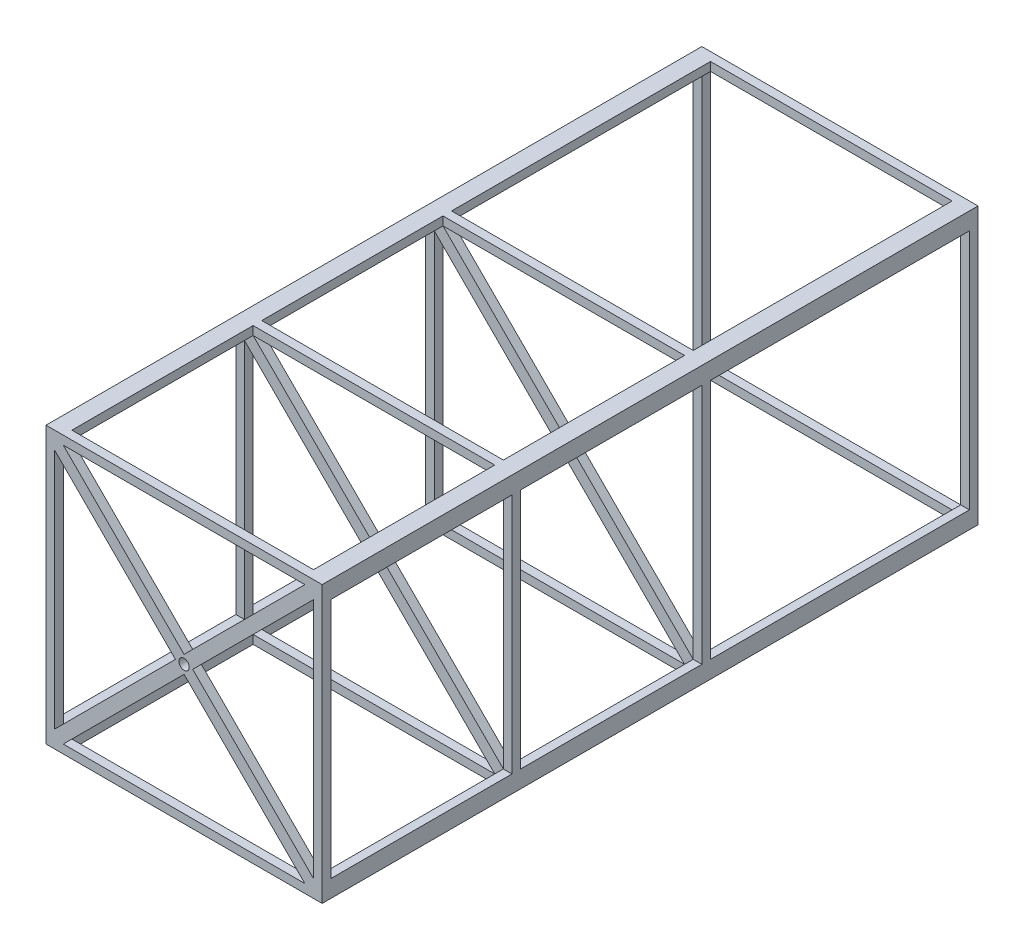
ISO-10303-21;
HEADER;
FILE_DESCRIPTION(('STEP AP214'),'2;1');
FILE_NAME('part.step','',(''),(''),'','','');
FILE_SCHEMA(('AUTOMOTIVE_DESIGN { 1 0 10303 214 1 1 1 1 }'));
ENDSEC;
DATA;
#1=APPLICATION_CONTEXT('core data for automotive mechanical design processes');
#2=APPLICATION_PROTOCOL_DEFINITION('international standard','automotive_design',2000,#1);
#3=PRODUCT_CONTEXT('',#1,'mechanical');
#4=PRODUCT('Part','Part','',(#3));
#5=PRODUCT_RELATED_PRODUCT_CATEGORY('part','',(#4));
#6=PRODUCT_DEFINITION_FORMATION('','',#4);
#7=PRODUCT_DEFINITION_CONTEXT('part definition',#1,'design');
#8=PRODUCT_DEFINITION('design','',#6,#7);
#9=PRODUCT_DEFINITION_SHAPE('','',#8);
#10=(LENGTH_UNIT() NAMED_UNIT(*) SI_UNIT(.MILLI.,.METRE.));
#11=(NAMED_UNIT(*) PLANE_ANGLE_UNIT() SI_UNIT($,.RADIAN.));
#12=(NAMED_UNIT(*) SI_UNIT($,.STERADIAN.) SOLID_ANGLE_UNIT());
#13=UNCERTAINTY_MEASURE_WITH_UNIT(LENGTH_MEASURE(1.E-05),#10,'distance_accuracy_value','');
#14=(GEOMETRIC_REPRESENTATION_CONTEXT(3) GLOBAL_UNCERTAINTY_ASSIGNED_CONTEXT((#13)) GLOBAL_UNIT_ASSIGNED_CONTEXT((#10,
#11,#12)) REPRESENTATION_CONTEXT('',''));
#15=CARTESIAN_POINT('',(0.,0.,0.));
#16=DIRECTION('',(0.,0.,1.));
#17=DIRECTION('',(1.,0.,0.));
#18=AXIS2_PLACEMENT_3D('',#15,#16,#17);
#19=CARTESIAN_POINT('',(0.,0.,110.));
#20=DIRECTION('',(0.,0.,1.));
#21=DIRECTION('',(1.,0.,0.));
#22=AXIS2_PLACEMENT_3D('',#19,#20,#21);
#23=PLANE('',#22);
#24=DIRECTION('',(1.,0.,0.));
#25=VECTOR('',#24,1.);
#26=CARTESIAN_POINT('',(0.,150.,110.));
#27=LINE('',#26,#25);
#28=CARTESIAN_POINT('',(155.,150.,110.));
#29=VERTEX_POINT('',#28);
#30=CARTESIAN_POINT('',(160.,150.,110.));
#31=VERTEX_POINT('',#30);
#32=EDGE_CURVE('E630',#29,#31,#27,.T.);
#33=ORIENTED_EDGE('',*,*,#32,.F.);
#34=DIRECTION('',(0.,1.,0.));
#35=VECTOR('',#34,1.);
#36=CARTESIAN_POINT('',(155.,0.,110.));
#37=LINE('',#36,#35);
#38=CARTESIAN_POINT('',(155.,10.,110.));
#39=VERTEX_POINT('',#38);
#40=EDGE_CURVE('E1055',#39,#29,#37,.T.);
#41=ORIENTED_EDGE('',*,*,#40,.F.);
#42=DIRECTION('',(-1.,0.,0.));
#43=VECTOR('',#42,1.);
#44=CARTESIAN_POINT('',(0.,9.9999999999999,110.));
#45=LINE('',#44,#43);
#46=CARTESIAN_POINT('',(160.,10.,110.));
#47=VERTEX_POINT('',#46);
#48=EDGE_CURVE('E673',#47,#39,#45,.T.);
#49=ORIENTED_EDGE('',*,*,#48,.F.);
#50=DIRECTION('',(0.,-1.,0.));
#51=VECTOR('',#50,1.);
#52=CARTESIAN_POINT('',(160.,0.,110.));
#53=LINE('',#52,#51);
#54=EDGE_CURVE('E1047',#31,#47,#53,.T.);
#55=ORIENTED_EDGE('',*,*,#54,.F.);
#56=EDGE_LOOP('',(#33,#41,#49,#55));
#57=FACE_BOUND('',#56,.T.);
#58=ADVANCED_FACE('F45',(#57),#23,.T.);
#59=CARTESIAN_POINT('',(80.,80.,110.));
#60=DIRECTION('',(0.,0.,1.));
#61=DIRECTION('',(1.,0.,0.));
#62=AXIS2_PLACEMENT_3D('',#59,#60,#61);
#63=CIRCLE('',#62,3.00000000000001);
#64=CARTESIAN_POINT('',(83.,80.,110.));
#65=VERTEX_POINT('',#64);
#66=EDGE_CURVE('E543',#65,#65,#63,.T.);
#67=ORIENTED_EDGE('',*,*,#66,.F.);
#68=EDGE_LOOP('',(#67));
#69=FACE_BOUND('',#68,.T.);
#70=DIRECTION('',(0.707106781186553,-0.707106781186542,0.));
#71=VECTOR('',#70,1.);
#72=CARTESIAN_POINT('',(152.499999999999,152.500000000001,110.));
#73=LINE('',#72,#71);
#74=CARTESIAN_POINT('',(150.,155.,110.));
#75=VERTEX_POINT('',#74);
#76=EDGE_CURVE('E622',#75,#29,#73,.T.);
#77=ORIENTED_EDGE('',*,*,#76,.F.);
#78=DIRECTION('',(-0.707106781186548,-0.707106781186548,0.));
#79=VECTOR('',#78,1.);
#80=CARTESIAN_POINT('',(-2.50000000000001,2.50000000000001,110.));
#81=LINE('',#80,#79);
#82=CARTESIAN_POINT('',(80.,85.,110.));
#83=VERTEX_POINT('',#82);
#84=EDGE_CURVE('E1072',#75,#83,#81,.T.);
#85=ORIENTED_EDGE('',*,*,#84,.T.);
#86=DIRECTION('',(-0.707106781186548,0.707106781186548,0.));
#87=VECTOR('',#86,1.);
#88=CARTESIAN_POINT('',(82.5,82.5,110.));
#89=LINE('',#88,#87);
#90=CARTESIAN_POINT('',(10.,155.,110.));
#91=VERTEX_POINT('',#90);
#92=EDGE_CURVE('E1075',#83,#91,#89,.T.);
#93=ORIENTED_EDGE('',*,*,#92,.T.);
#94=DIRECTION('',(0.707106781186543,0.707106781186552,0.));
#95=VECTOR('',#94,1.);
#96=CARTESIAN_POINT('',(-72.4999999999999,72.4999999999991,110.));
#97=LINE('',#96,#95);
#98=CARTESIAN_POINT('',(5.,150.,110.));
#99=VERTEX_POINT('',#98);
#100=EDGE_CURVE('E1040',#99,#91,#97,.T.);
#101=ORIENTED_EDGE('',*,*,#100,.F.);
#102=DIRECTION('',(0.707106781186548,-0.707106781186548,0.));
#103=VECTOR('',#102,1.);
#104=CARTESIAN_POINT('',(77.5,77.5,110.));
#105=LINE('',#104,#103);
#106=CARTESIAN_POINT('',(75.,80.,110.));
#107=VERTEX_POINT('',#106);
#108=EDGE_CURVE('E1087',#99,#107,#105,.T.);
#109=ORIENTED_EDGE('',*,*,#108,.T.);
#110=DIRECTION('',(-0.707106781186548,-0.707106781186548,0.));
#111=VECTOR('',#110,1.);
#112=CARTESIAN_POINT('',(-2.50000000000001,2.50000000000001,110.));
#113=LINE('',#112,#111);
#114=CARTESIAN_POINT('',(5.00000000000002,10.,110.));
#115=VERTEX_POINT('',#114);
#116=EDGE_CURVE('E1081',#107,#115,#113,.T.);
#117=ORIENTED_EDGE('',*,*,#116,.T.);
#118=DIRECTION('',(-0.707106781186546,0.707106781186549,0.));
#119=VECTOR('',#118,1.);
#120=CARTESIAN_POINT('',(7.50000000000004,7.5,110.));
#121=LINE('',#120,#119);
#122=CARTESIAN_POINT('',(10.,4.99999999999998,110.));
#123=VERTEX_POINT('',#122);
#124=EDGE_CURVE('E758',#123,#115,#121,.T.);
#125=ORIENTED_EDGE('',*,*,#124,.F.);
#126=DIRECTION('',(-0.707106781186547,-0.707106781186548,0.));
#127=VECTOR('',#126,1.);
#128=CARTESIAN_POINT('',(2.50000000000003,-2.50000000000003,110.));
#129=LINE('',#128,#127);
#130=CARTESIAN_POINT('',(80.,75.,110.));
#131=VERTEX_POINT('',#130);
#132=EDGE_CURVE('E1069',#131,#123,#129,.T.);
#133=ORIENTED_EDGE('',*,*,#132,.F.);
#134=DIRECTION('',(0.707106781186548,-0.707106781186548,0.));
#135=VECTOR('',#134,1.);
#136=CARTESIAN_POINT('',(77.5,77.5,110.));
#137=LINE('',#136,#135);
#138=CARTESIAN_POINT('',(150.,5.,110.));
#139=VERTEX_POINT('',#138);
#140=EDGE_CURVE('E1063',#131,#139,#137,.T.);
#141=ORIENTED_EDGE('',*,*,#140,.T.);
#142=DIRECTION('',(-0.707106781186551,-0.707106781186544,0.));
#143=VECTOR('',#142,1.);
#144=CARTESIAN_POINT('',(72.4999999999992,-72.5,110.));
#145=LINE('',#144,#143);
#146=EDGE_CURVE('E683',#39,#139,#145,.T.);
#147=ORIENTED_EDGE('',*,*,#146,.F.);
#148=DIRECTION('',(-0.707106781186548,0.707106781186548,0.));
#149=VECTOR('',#148,1.);
#150=CARTESIAN_POINT('',(82.5,82.5,110.));
#151=LINE('',#150,#149);
#152=CARTESIAN_POINT('',(85.,80.,110.));
#153=VERTEX_POINT('',#152);
#154=EDGE_CURVE('E1058',#39,#153,#151,.T.);
#155=ORIENTED_EDGE('',*,*,#154,.T.);
#156=DIRECTION('',(-0.707106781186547,-0.707106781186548,0.));
#157=VECTOR('',#156,1.);
#158=CARTESIAN_POINT('',(2.50000000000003,-2.50000000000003,110.));
#159=LINE('',#158,#157);
#160=EDGE_CURVE('E1060',#29,#153,#159,.T.);
#161=ORIENTED_EDGE('',*,*,#160,.F.);
#162=EDGE_LOOP('',(#77,#85,#93,#101,#109,#117,#125,#133,#141,#147,#155,#161));
#163=FACE_BOUND('',#162,.T.);
#164=ADVANCED_FACE('F1264',(#69,#163),#23,.T.);
#165=CARTESIAN_POINT('',(0.,0.,105.));
#166=DIRECTION('',(0.,0.,1.));
#167=DIRECTION('',(1.,0.,0.));
#168=AXIS2_PLACEMENT_3D('',#165,#166,#167);
#169=PLANE('',#168);
#170=DIRECTION('',(0.,1.,0.));
#171=VECTOR('',#170,1.);
#172=CARTESIAN_POINT('',(155.,0.,105.));
#173=LINE('',#172,#171);
#174=CARTESIAN_POINT('',(155.,10.,105.));
#175=VERTEX_POINT('',#174);
#176=CARTESIAN_POINT('',(155.,150.,105.));
#177=VERTEX_POINT('',#176);
#178=EDGE_CURVE('E1097',#175,#177,#173,.T.);
#179=ORIENTED_EDGE('',*,*,#178,.T.);
#180=DIRECTION('',(1.,0.,0.));
#181=VECTOR('',#180,1.);
#182=CARTESIAN_POINT('',(0.,150.,105.));
#183=LINE('',#182,#181);
#184=CARTESIAN_POINT('',(160.,150.,105.));
#185=VERTEX_POINT('',#184);
#186=EDGE_CURVE('E60',#177,#185,#183,.T.);
#187=ORIENTED_EDGE('',*,*,#186,.T.);
#188=DIRECTION('',(0.,-1.,0.));
#189=VECTOR('',#188,1.);
#190=CARTESIAN_POINT('',(160.,0.,105.));
#191=LINE('',#190,#189);
#192=CARTESIAN_POINT('',(160.,10.,105.));
#193=VERTEX_POINT('',#192);
#194=EDGE_CURVE('E1091',#185,#193,#191,.T.);
#195=ORIENTED_EDGE('',*,*,#194,.T.);
#196=DIRECTION('',(-1.,0.,0.));
#197=VECTOR('',#196,1.);
#198=CARTESIAN_POINT('',(0.,9.9999999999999,105.));
#199=LINE('',#198,#197);
#200=EDGE_CURVE('E671',#193,#175,#199,.T.);
#201=ORIENTED_EDGE('',*,*,#200,.T.);
#202=EDGE_LOOP('',(#179,#187,#195,#201));
#203=FACE_BOUND('',#202,.T.);
#204=ADVANCED_FACE('F1474',(#203),#169,.F.);
#205=CARTESIAN_POINT('',(80.,80.,105.));
#206=DIRECTION('',(0.,0.,1.));
#207=DIRECTION('',(1.,0.,0.));
#208=AXIS2_PLACEMENT_3D('',#205,#206,#207);
#209=CIRCLE('',#208,3.00000000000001);
#210=CARTESIAN_POINT('',(83.,80.,105.));
#211=VERTEX_POINT('',#210);
#212=EDGE_CURVE('E2966',#211,#211,#209,.T.);
#213=ORIENTED_EDGE('',*,*,#212,.T.);
#214=EDGE_LOOP('',(#213));
#215=FACE_BOUND('',#214,.T.);
#216=DIRECTION('',(-0.707106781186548,-0.707106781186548,0.));
#217=VECTOR('',#216,1.);
#218=CARTESIAN_POINT('',(-2.50000000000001,2.50000000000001,105.));
#219=LINE('',#218,#217);
#220=CARTESIAN_POINT('',(150.,155.,105.));
#221=VERTEX_POINT('',#220);
#222=CARTESIAN_POINT('',(80.,85.,105.));
#223=VERTEX_POINT('',#222);
#224=EDGE_CURVE('E1114',#221,#223,#219,.T.);
#225=ORIENTED_EDGE('',*,*,#224,.F.);
#226=DIRECTION('',(0.707106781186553,-0.707106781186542,0.));
#227=VECTOR('',#226,1.);
#228=CARTESIAN_POINT('',(152.499999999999,152.500000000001,105.));
#229=LINE('',#228,#227);
#230=EDGE_CURVE('E620',#221,#177,#229,.T.);
#231=ORIENTED_EDGE('',*,*,#230,.T.);
#232=DIRECTION('',(-0.707106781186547,-0.707106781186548,0.));
#233=VECTOR('',#232,1.);
#234=CARTESIAN_POINT('',(2.50000000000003,-2.50000000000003,105.));
#235=LINE('',#234,#233);
#236=CARTESIAN_POINT('',(85.,80.,105.));
#237=VERTEX_POINT('',#236);
#238=EDGE_CURVE('E1102',#177,#237,#235,.T.);
#239=ORIENTED_EDGE('',*,*,#238,.T.);
#240=DIRECTION('',(-0.707106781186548,0.707106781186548,0.));
#241=VECTOR('',#240,1.);
#242=CARTESIAN_POINT('',(82.5,82.5,105.));
#243=LINE('',#242,#241);
#244=EDGE_CURVE('E1099',#175,#237,#243,.T.);
#245=ORIENTED_EDGE('',*,*,#244,.F.);
#246=DIRECTION('',(-0.707106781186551,-0.707106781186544,0.));
#247=VECTOR('',#246,1.);
#248=CARTESIAN_POINT('',(72.4999999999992,-72.5,105.));
#249=LINE('',#248,#247);
#250=CARTESIAN_POINT('',(150.,5.,105.));
#251=VERTEX_POINT('',#250);
#252=EDGE_CURVE('E681',#175,#251,#249,.T.);
#253=ORIENTED_EDGE('',*,*,#252,.T.);
#254=DIRECTION('',(0.707106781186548,-0.707106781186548,0.));
#255=VECTOR('',#254,1.);
#256=CARTESIAN_POINT('',(77.5,77.5,105.));
#257=LINE('',#256,#255);
#258=CARTESIAN_POINT('',(80.,75.,105.));
#259=VERTEX_POINT('',#258);
#260=EDGE_CURVE('E1105',#259,#251,#257,.T.);
#261=ORIENTED_EDGE('',*,*,#260,.F.);
#262=DIRECTION('',(-0.707106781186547,-0.707106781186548,0.));
#263=VECTOR('',#262,1.);
#264=CARTESIAN_POINT('',(2.50000000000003,-2.50000000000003,105.));
#265=LINE('',#264,#263);
#266=CARTESIAN_POINT('',(10.,4.99999999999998,105.));
#267=VERTEX_POINT('',#266);
#268=EDGE_CURVE('E1111',#259,#267,#265,.T.);
#269=ORIENTED_EDGE('',*,*,#268,.T.);
#270=DIRECTION('',(-0.707106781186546,0.707106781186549,0.));
#271=VECTOR('',#270,1.);
#272=CARTESIAN_POINT('',(7.50000000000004,7.5,105.));
#273=LINE('',#272,#271);
#274=CARTESIAN_POINT('',(5.00000000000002,10.,105.));
#275=VERTEX_POINT('',#274);
#276=EDGE_CURVE('E755',#267,#275,#273,.T.);
#277=ORIENTED_EDGE('',*,*,#276,.T.);
#278=DIRECTION('',(-0.707106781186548,-0.707106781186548,0.));
#279=VECTOR('',#278,1.);
#280=CARTESIAN_POINT('',(-2.50000000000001,2.50000000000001,105.));
#281=LINE('',#280,#279);
#282=CARTESIAN_POINT('',(75.,80.,105.));
#283=VERTEX_POINT('',#282);
#284=EDGE_CURVE('E1123',#283,#275,#281,.T.);
#285=ORIENTED_EDGE('',*,*,#284,.F.);
#286=DIRECTION('',(0.707106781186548,-0.707106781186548,0.));
#287=VECTOR('',#286,1.);
#288=CARTESIAN_POINT('',(77.5,77.5,105.));
#289=LINE('',#288,#287);
#290=CARTESIAN_POINT('',(5.,150.,105.));
#291=VERTEX_POINT('',#290);
#292=EDGE_CURVE('E1048',#291,#283,#289,.T.);
#293=ORIENTED_EDGE('',*,*,#292,.F.);
#294=DIRECTION('',(0.707106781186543,0.707106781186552,0.));
#295=VECTOR('',#294,1.);
#296=CARTESIAN_POINT('',(-72.4999999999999,72.4999999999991,105.));
#297=LINE('',#296,#295);
#298=CARTESIAN_POINT('',(10.,155.,105.));
#299=VERTEX_POINT('',#298);
#300=EDGE_CURVE('E1173',#291,#299,#297,.T.);
#301=ORIENTED_EDGE('',*,*,#300,.T.);
#302=DIRECTION('',(-0.707106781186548,0.707106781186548,0.));
#303=VECTOR('',#302,1.);
#304=CARTESIAN_POINT('',(82.5,82.5,105.));
#305=LINE('',#304,#303);
#306=EDGE_CURVE('E1117',#223,#299,#305,.T.);
#307=ORIENTED_EDGE('',*,*,#306,.F.);
#308=EDGE_LOOP('',(#225,#231,#239,#245,#253,#261,#269,#277,#285,#293,#301,#307));
#309=FACE_BOUND('',#308,.T.);
#310=ADVANCED_FACE('F1278',(#215,#309),#169,.F.);
#311=CARTESIAN_POINT('',(0.,0.,220.));
#312=DIRECTION('',(0.,0.,1.));
#313=DIRECTION('',(1.,0.,0.));
#314=AXIS2_PLACEMENT_3D('',#311,#312,#313);
#315=PLANE('',#314);
#316=DIRECTION('',(1.,0.,0.));
#317=VECTOR('',#316,1.);
#318=CARTESIAN_POINT('',(0.,150.,220.));
#319=LINE('',#318,#317);
#320=CARTESIAN_POINT('',(155.,150.,220.));
#321=VERTEX_POINT('',#320);
#322=CARTESIAN_POINT('',(160.,150.,220.));
#323=VERTEX_POINT('',#322);
#324=EDGE_CURVE('E627',#321,#323,#319,.T.);
#325=ORIENTED_EDGE('',*,*,#324,.F.);
#326=DIRECTION('',(0.,1.,0.));
#327=VECTOR('',#326,1.);
#328=CARTESIAN_POINT('',(155.,0.,220.));
#329=LINE('',#328,#327);
#330=CARTESIAN_POINT('',(155.,10.,220.));
#331=VERTEX_POINT('',#330);
#332=EDGE_CURVE('E888',#331,#321,#329,.T.);
#333=ORIENTED_EDGE('',*,*,#332,.F.);
#334=DIRECTION('',(-1.,0.,0.));
#335=VECTOR('',#334,1.);
#336=CARTESIAN_POINT('',(0.,9.9999999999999,220.));
#337=LINE('',#336,#335);
#338=CARTESIAN_POINT('',(160.,10.,220.));
#339=VERTEX_POINT('',#338);
#340=EDGE_CURVE('E669',#339,#331,#337,.T.);
#341=ORIENTED_EDGE('',*,*,#340,.F.);
#342=DIRECTION('',(0.,-1.,0.));
#343=VECTOR('',#342,1.);
#344=CARTESIAN_POINT('',(160.,0.,220.));
#345=LINE('',#344,#343);
#346=EDGE_CURVE('E880',#323,#339,#345,.T.);
#347=ORIENTED_EDGE('',*,*,#346,.F.);
#348=EDGE_LOOP('',(#325,#333,#341,#347));
#349=FACE_BOUND('',#348,.T.);
#350=ADVANCED_FACE('F1553',(#349),#315,.T.);
#351=CARTESIAN_POINT('',(80.,80.,220.));
#352=DIRECTION('',(0.,0.,1.));
#353=DIRECTION('',(1.,0.,0.));
#354=AXIS2_PLACEMENT_3D('',#351,#352,#353);
#355=CIRCLE('',#354,3.00000000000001);
#356=CARTESIAN_POINT('',(83.,80.,220.));
#357=VERTEX_POINT('',#356);
#358=EDGE_CURVE('E2967',#357,#357,#355,.T.);
#359=ORIENTED_EDGE('',*,*,#358,.F.);
#360=EDGE_LOOP('',(#359));
#361=FACE_BOUND('',#360,.T.);
#362=DIRECTION('',(0.707106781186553,-0.707106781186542,0.));
#363=VECTOR('',#362,1.);
#364=CARTESIAN_POINT('',(152.499999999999,152.500000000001,220.));
#365=LINE('',#364,#363);
#366=CARTESIAN_POINT('',(150.,155.,220.));
#367=VERTEX_POINT('',#366);
#368=EDGE_CURVE('E618',#367,#321,#365,.T.);
#369=ORIENTED_EDGE('',*,*,#368,.F.);
#370=DIRECTION('',(-0.707106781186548,-0.707106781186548,0.));
#371=VECTOR('',#370,1.);
#372=CARTESIAN_POINT('',(-2.50000000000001,2.50000000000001,220.));
#373=LINE('',#372,#371);
#374=CARTESIAN_POINT('',(80.,85.,220.));
#375=VERTEX_POINT('',#374);
#376=EDGE_CURVE('E905',#367,#375,#373,.T.);
#377=ORIENTED_EDGE('',*,*,#376,.T.);
#378=DIRECTION('',(-0.707106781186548,0.707106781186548,0.));
#379=VECTOR('',#378,1.);
#380=CARTESIAN_POINT('',(82.5,82.5,220.));
#381=LINE('',#380,#379);
#382=CARTESIAN_POINT('',(10.,155.,220.));
#383=VERTEX_POINT('',#382);
#384=EDGE_CURVE('E908',#375,#383,#381,.T.);
#385=ORIENTED_EDGE('',*,*,#384,.T.);
#386=DIRECTION('',(-0.707106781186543,-0.707106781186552,0.));
#387=VECTOR('',#386,1.);
#388=CARTESIAN_POINT('',(5.,150.,220.));
#389=LINE('',#388,#387);
#390=CARTESIAN_POINT('',(5.,150.,220.));
#391=VERTEX_POINT('',#390);
#392=EDGE_CURVE('E1003',#383,#391,#389,.T.);
#393=ORIENTED_EDGE('',*,*,#392,.T.);
#394=DIRECTION('',(0.707106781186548,-0.707106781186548,0.));
#395=VECTOR('',#394,1.);
#396=CARTESIAN_POINT('',(77.5,77.5,220.));
#397=LINE('',#396,#395);
#398=CARTESIAN_POINT('',(75.,80.,220.));
#399=VERTEX_POINT('',#398);
#400=EDGE_CURVE('E920',#391,#399,#397,.T.);
#401=ORIENTED_EDGE('',*,*,#400,.T.);
#402=DIRECTION('',(-0.707106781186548,-0.707106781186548,0.));
#403=VECTOR('',#402,1.);
#404=CARTESIAN_POINT('',(-2.50000000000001,2.50000000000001,220.));
#405=LINE('',#404,#403);
#406=CARTESIAN_POINT('',(5.00000000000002,10.,220.));
#407=VERTEX_POINT('',#406);
#408=EDGE_CURVE('E914',#399,#407,#405,.T.);
#409=ORIENTED_EDGE('',*,*,#408,.T.);
#410=DIRECTION('',(-0.707106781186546,0.707106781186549,0.));
#411=VECTOR('',#410,1.);
#412=CARTESIAN_POINT('',(7.50000000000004,7.5,220.));
#413=LINE('',#412,#411);
#414=CARTESIAN_POINT('',(10.,4.99999999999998,220.));
#415=VERTEX_POINT('',#414);
#416=EDGE_CURVE('E752',#415,#407,#413,.T.);
#417=ORIENTED_EDGE('',*,*,#416,.F.);
#418=DIRECTION('',(-0.707106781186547,-0.707106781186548,0.));
#419=VECTOR('',#418,1.);
#420=CARTESIAN_POINT('',(2.50000000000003,-2.50000000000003,220.));
#421=LINE('',#420,#419);
#422=CARTESIAN_POINT('',(80.,75.,220.));
#423=VERTEX_POINT('',#422);
#424=EDGE_CURVE('E902',#423,#415,#421,.T.);
#425=ORIENTED_EDGE('',*,*,#424,.F.);
#426=DIRECTION('',(0.707106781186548,-0.707106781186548,0.));
#427=VECTOR('',#426,1.);
#428=CARTESIAN_POINT('',(77.5,77.5,220.));
#429=LINE('',#428,#427);
#430=CARTESIAN_POINT('',(150.,5.,220.));
#431=VERTEX_POINT('',#430);
#432=EDGE_CURVE('E896',#423,#431,#429,.T.);
#433=ORIENTED_EDGE('',*,*,#432,.T.);
#434=DIRECTION('',(-0.707106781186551,-0.707106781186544,0.));
#435=VECTOR('',#434,1.);
#436=CARTESIAN_POINT('',(72.4999999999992,-72.5,220.));
#437=LINE('',#436,#435);
#438=EDGE_CURVE('E679',#331,#431,#437,.T.);
#439=ORIENTED_EDGE('',*,*,#438,.F.);
#440=DIRECTION('',(-0.707106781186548,0.707106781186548,0.));
#441=VECTOR('',#440,1.);
#442=CARTESIAN_POINT('',(82.5,82.5,220.));
#443=LINE('',#442,#441);
#444=CARTESIAN_POINT('',(85.,80.,220.));
#445=VERTEX_POINT('',#444);
#446=EDGE_CURVE('E891',#331,#445,#443,.T.);
#447=ORIENTED_EDGE('',*,*,#446,.T.);
#448=DIRECTION('',(-0.707106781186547,-0.707106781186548,0.));
#449=VECTOR('',#448,1.);
#450=CARTESIAN_POINT('',(2.50000000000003,-2.50000000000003,220.));
#451=LINE('',#450,#449);
#452=EDGE_CURVE('E893',#321,#445,#451,.T.);
#453=ORIENTED_EDGE('',*,*,#452,.F.);
#454=EDGE_LOOP('',(#369,#377,#385,#393,#401,#409,#417,#425,#433,#439,#447,#453));
#455=FACE_BOUND('',#454,.T.);
#456=ADVANCED_FACE('F1444',(#361,#455),#315,.T.);
#457=CARTESIAN_POINT('',(0.,0.,215.));
#458=DIRECTION('',(0.,0.,1.));
#459=DIRECTION('',(1.,0.,0.));
#460=AXIS2_PLACEMENT_3D('',#457,#458,#459);
#461=PLANE('',#460);
#462=DIRECTION('',(0.,1.,0.));
#463=VECTOR('',#462,1.);
#464=CARTESIAN_POINT('',(155.,0.,215.));
#465=LINE('',#464,#463);
#466=CARTESIAN_POINT('',(155.,10.,215.));
#467=VERTEX_POINT('',#466);
#468=CARTESIAN_POINT('',(155.,150.,215.));
#469=VERTEX_POINT('',#468);
#470=EDGE_CURVE('E930',#467,#469,#465,.T.);
#471=ORIENTED_EDGE('',*,*,#470,.T.);
#472=DIRECTION('',(1.,0.,0.));
#473=VECTOR('',#472,1.);
#474=CARTESIAN_POINT('',(0.,150.,215.));
#475=LINE('',#474,#473);
#476=CARTESIAN_POINT('',(160.,150.,215.));
#477=VERTEX_POINT('',#476);
#478=EDGE_CURVE('E625',#469,#477,#475,.T.);
#479=ORIENTED_EDGE('',*,*,#478,.T.);
#480=DIRECTION('',(0.,-1.,0.));
#481=VECTOR('',#480,1.);
#482=CARTESIAN_POINT('',(160.,0.,215.));
#483=LINE('',#482,#481);
#484=CARTESIAN_POINT('',(160.,10.,215.));
#485=VERTEX_POINT('',#484);
#486=EDGE_CURVE('E924',#477,#485,#483,.T.);
#487=ORIENTED_EDGE('',*,*,#486,.T.);
#488=DIRECTION('',(-1.,0.,0.));
#489=VECTOR('',#488,1.);
#490=CARTESIAN_POINT('',(0.,9.9999999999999,215.));
#491=LINE('',#490,#489);
#492=EDGE_CURVE('E667',#485,#467,#491,.T.);
#493=ORIENTED_EDGE('',*,*,#492,.T.);
#494=EDGE_LOOP('',(#471,#479,#487,#493));
#495=FACE_BOUND('',#494,.T.);
#496=ADVANCED_FACE('F1557',(#495),#461,.F.);
#497=CARTESIAN_POINT('',(80.,80.,215.));
#498=DIRECTION('',(0.,0.,1.));
#499=DIRECTION('',(1.,0.,0.));
#500=AXIS2_PLACEMENT_3D('',#497,#498,#499);
#501=CIRCLE('',#500,3.00000000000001);
#502=CARTESIAN_POINT('',(83.,80.,215.));
#503=VERTEX_POINT('',#502);
#504=EDGE_CURVE('E2970',#503,#503,#501,.T.);
#505=ORIENTED_EDGE('',*,*,#504,.T.);
#506=EDGE_LOOP('',(#505));
#507=FACE_BOUND('',#506,.T.);
#508=DIRECTION('',(-0.707106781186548,-0.707106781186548,0.));
#509=VECTOR('',#508,1.);
#510=CARTESIAN_POINT('',(-2.50000000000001,2.50000000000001,215.));
#511=LINE('',#510,#509);
#512=CARTESIAN_POINT('',(150.,155.,215.));
#513=VERTEX_POINT('',#512);
#514=CARTESIAN_POINT('',(80.,85.,215.));
#515=VERTEX_POINT('',#514);
#516=EDGE_CURVE('E948',#513,#515,#511,.T.);
#517=ORIENTED_EDGE('',*,*,#516,.F.);
#518=DIRECTION('',(0.707106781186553,-0.707106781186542,0.));
#519=VECTOR('',#518,1.);
#520=CARTESIAN_POINT('',(152.499999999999,152.500000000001,215.));
#521=LINE('',#520,#519);
#522=EDGE_CURVE('E616',#513,#469,#521,.T.);
#523=ORIENTED_EDGE('',*,*,#522,.T.);
#524=DIRECTION('',(-0.707106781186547,-0.707106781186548,0.));
#525=VECTOR('',#524,1.);
#526=CARTESIAN_POINT('',(2.50000000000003,-2.50000000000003,215.));
#527=LINE('',#526,#525);
#528=CARTESIAN_POINT('',(85.,80.,215.));
#529=VERTEX_POINT('',#528);
#530=EDGE_CURVE('E936',#469,#529,#527,.T.);
#531=ORIENTED_EDGE('',*,*,#530,.T.);
#532=DIRECTION('',(-0.707106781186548,0.707106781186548,0.));
#533=VECTOR('',#532,1.);
#534=CARTESIAN_POINT('',(82.5,82.5,215.));
#535=LINE('',#534,#533);
#536=EDGE_CURVE('E933',#467,#529,#535,.T.);
#537=ORIENTED_EDGE('',*,*,#536,.F.);
#538=DIRECTION('',(-0.707106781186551,-0.707106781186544,0.));
#539=VECTOR('',#538,1.);
#540=CARTESIAN_POINT('',(72.4999999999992,-72.5,215.));
#541=LINE('',#540,#539);
#542=CARTESIAN_POINT('',(150.,5.,215.));
#543=VERTEX_POINT('',#542);
#544=EDGE_CURVE('E677',#467,#543,#541,.T.);
#545=ORIENTED_EDGE('',*,*,#544,.T.);
#546=DIRECTION('',(0.707106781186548,-0.707106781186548,0.));
#547=VECTOR('',#546,1.);
#548=CARTESIAN_POINT('',(77.5,77.5,215.));
#549=LINE('',#548,#547);
#550=CARTESIAN_POINT('',(80.,75.,215.));
#551=VERTEX_POINT('',#550);
#552=EDGE_CURVE('E939',#551,#543,#549,.T.);
#553=ORIENTED_EDGE('',*,*,#552,.F.);
#554=DIRECTION('',(-0.707106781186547,-0.707106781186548,0.));
#555=VECTOR('',#554,1.);
#556=CARTESIAN_POINT('',(2.50000000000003,-2.50000000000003,215.));
#557=LINE('',#556,#555);
#558=CARTESIAN_POINT('',(10.,4.99999999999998,215.));
#559=VERTEX_POINT('',#558);
#560=EDGE_CURVE('E945',#551,#559,#557,.T.);
#561=ORIENTED_EDGE('',*,*,#560,.T.);
#562=DIRECTION('',(-0.707106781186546,0.707106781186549,0.));
#563=VECTOR('',#562,1.);
#564=CARTESIAN_POINT('',(7.50000000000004,7.5,215.));
#565=LINE('',#564,#563);
#566=CARTESIAN_POINT('',(5.00000000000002,10.,215.));
#567=VERTEX_POINT('',#566);
#568=EDGE_CURVE('E749',#559,#567,#565,.T.);
#569=ORIENTED_EDGE('',*,*,#568,.T.);
#570=DIRECTION('',(-0.707106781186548,-0.707106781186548,0.));
#571=VECTOR('',#570,1.);
#572=CARTESIAN_POINT('',(-2.50000000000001,2.50000000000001,215.));
#573=LINE('',#572,#571);
#574=CARTESIAN_POINT('',(75.,80.,215.));
#575=VERTEX_POINT('',#574);
#576=EDGE_CURVE('E957',#575,#567,#573,.T.);
#577=ORIENTED_EDGE('',*,*,#576,.F.);
#578=DIRECTION('',(0.707106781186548,-0.707106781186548,0.));
#579=VECTOR('',#578,1.);
#580=CARTESIAN_POINT('',(77.5,77.5,215.));
#581=LINE('',#580,#579);
#582=CARTESIAN_POINT('',(5.,150.,215.));
#583=VERTEX_POINT('',#582);
#584=EDGE_CURVE('E881',#583,#575,#581,.T.);
#585=ORIENTED_EDGE('',*,*,#584,.F.);
#586=DIRECTION('',(-0.707106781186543,-0.707106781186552,0.));
#587=VECTOR('',#586,1.);
#588=CARTESIAN_POINT('',(5.,150.,215.));
#589=LINE('',#588,#587);
#590=CARTESIAN_POINT('',(10.,155.,215.));
#591=VERTEX_POINT('',#590);
#592=EDGE_CURVE('E974',#591,#583,#589,.T.);
#593=ORIENTED_EDGE('',*,*,#592,.F.);
#594=DIRECTION('',(-0.707106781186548,0.707106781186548,0.));
#595=VECTOR('',#594,1.);
#596=CARTESIAN_POINT('',(82.5,82.5,215.));
#597=LINE('',#596,#595);
#598=EDGE_CURVE('E951',#515,#591,#597,.T.);
#599=ORIENTED_EDGE('',*,*,#598,.F.);
#600=EDGE_LOOP('',(#517,#523,#531,#537,#545,#553,#561,#569,#577,#585,#593,#599));
#601=FACE_BOUND('',#600,.T.);
#602=ADVANCED_FACE('F1437',(#507,#601),#461,.F.);
#603=CARTESIAN_POINT('',(0.,0.,325.));
#604=DIRECTION('',(0.,0.,1.));
#605=DIRECTION('',(1.,0.,0.));
#606=AXIS2_PLACEMENT_3D('',#603,#604,#605);
#607=PLANE('',#606);
#608=DIRECTION('',(0.,1.,0.));
#609=VECTOR('',#608,1.);
#610=CARTESIAN_POINT('',(155.,0.,325.));
#611=LINE('',#610,#609);
#612=CARTESIAN_POINT('',(155.,10.,325.));
#613=VERTEX_POINT('',#612);
#614=CARTESIAN_POINT('',(155.,150.,325.));
#615=VERTEX_POINT('',#614);
#616=EDGE_CURVE('E805',#613,#615,#611,.T.);
#617=ORIENTED_EDGE('',*,*,#616,.T.);
#618=DIRECTION('',(1.,0.,0.));
#619=VECTOR('',#618,1.);
#620=CARTESIAN_POINT('',(0.,150.,325.));
#621=LINE('',#620,#619);
#622=CARTESIAN_POINT('',(160.,150.,325.));
#623=VERTEX_POINT('',#622);
#624=EDGE_CURVE('E68',#615,#623,#621,.T.);
#625=ORIENTED_EDGE('',*,*,#624,.T.);
#626=DIRECTION('',(0.,-1.,0.));
#627=VECTOR('',#626,1.);
#628=CARTESIAN_POINT('',(160.,0.,325.));
#629=LINE('',#628,#627);
#630=CARTESIAN_POINT('',(160.,10.,325.));
#631=VERTEX_POINT('',#630);
#632=EDGE_CURVE('E799',#623,#631,#629,.T.);
#633=ORIENTED_EDGE('',*,*,#632,.T.);
#634=DIRECTION('',(-1.,0.,0.));
#635=VECTOR('',#634,1.);
#636=CARTESIAN_POINT('',(0.,9.9999999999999,325.));
#637=LINE('',#636,#635);
#638=EDGE_CURVE('E665',#631,#613,#637,.T.);
#639=ORIENTED_EDGE('',*,*,#638,.T.);
#640=EDGE_LOOP('',(#617,#625,#633,#639));
#641=FACE_BOUND('',#640,.T.);
#642=ADVANCED_FACE('F1502',(#641),#607,.F.);
#643=CARTESIAN_POINT('',(80.,80.,325.));
#644=DIRECTION('',(0.,0.,1.));
#645=DIRECTION('',(1.,0.,0.));
#646=AXIS2_PLACEMENT_3D('',#643,#644,#645);
#647=CIRCLE('',#646,3.00000000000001);
#648=CARTESIAN_POINT('',(83.,80.,325.));
#649=VERTEX_POINT('',#648);
#650=EDGE_CURVE('E2975',#649,#649,#647,.T.);
#651=ORIENTED_EDGE('',*,*,#650,.T.);
#652=EDGE_LOOP('',(#651));
#653=FACE_BOUND('',#652,.T.);
#654=DIRECTION('',(-0.707106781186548,-0.707106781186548,0.));
#655=VECTOR('',#654,1.);
#656=CARTESIAN_POINT('',(-2.50000000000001,2.50000000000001,325.));
#657=LINE('',#656,#655);
#658=CARTESIAN_POINT('',(150.,155.,325.));
#659=VERTEX_POINT('',#658);
#660=CARTESIAN_POINT('',(80.,85.,325.));
#661=VERTEX_POINT('',#660);
#662=EDGE_CURVE('E822',#659,#661,#657,.T.);
#663=ORIENTED_EDGE('',*,*,#662,.F.);
#664=DIRECTION('',(0.707106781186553,-0.707106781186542,0.));
#665=VECTOR('',#664,1.);
#666=CARTESIAN_POINT('',(152.499999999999,152.500000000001,325.));
#667=LINE('',#666,#665);
#668=EDGE_CURVE('E614',#659,#615,#667,.T.);
#669=ORIENTED_EDGE('',*,*,#668,.T.);
#670=DIRECTION('',(-0.707106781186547,-0.707106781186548,0.));
#671=VECTOR('',#670,1.);
#672=CARTESIAN_POINT('',(2.50000000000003,-2.50000000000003,325.));
#673=LINE('',#672,#671);
#674=CARTESIAN_POINT('',(85.,80.,325.));
#675=VERTEX_POINT('',#674);
#676=EDGE_CURVE('E810',#615,#675,#673,.T.);
#677=ORIENTED_EDGE('',*,*,#676,.T.);
#678=DIRECTION('',(-0.707106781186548,0.707106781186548,0.));
#679=VECTOR('',#678,1.);
#680=CARTESIAN_POINT('',(82.5,82.5,325.));
#681=LINE('',#680,#679);
#682=EDGE_CURVE('E807',#613,#675,#681,.T.);
#683=ORIENTED_EDGE('',*,*,#682,.F.);
#684=DIRECTION('',(-0.707106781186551,-0.707106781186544,0.));
#685=VECTOR('',#684,1.);
#686=CARTESIAN_POINT('',(72.4999999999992,-72.5,325.));
#687=LINE('',#686,#685);
#688=CARTESIAN_POINT('',(150.,5.,325.));
#689=VERTEX_POINT('',#688);
#690=EDGE_CURVE('E675',#613,#689,#687,.T.);
#691=ORIENTED_EDGE('',*,*,#690,.T.);
#692=DIRECTION('',(0.707106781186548,-0.707106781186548,0.));
#693=VECTOR('',#692,1.);
#694=CARTESIAN_POINT('',(77.5,77.5,325.));
#695=LINE('',#694,#693);
#696=CARTESIAN_POINT('',(80.,75.,325.));
#697=VERTEX_POINT('',#696);
#698=EDGE_CURVE('E813',#697,#689,#695,.T.);
#699=ORIENTED_EDGE('',*,*,#698,.F.);
#700=DIRECTION('',(-0.707106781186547,-0.707106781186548,0.));
#701=VECTOR('',#700,1.);
#702=CARTESIAN_POINT('',(2.50000000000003,-2.50000000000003,325.));
#703=LINE('',#702,#701);
#704=CARTESIAN_POINT('',(10.,4.99999999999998,325.));
#705=VERTEX_POINT('',#704);
#706=EDGE_CURVE('E819',#697,#705,#703,.T.);
#707=ORIENTED_EDGE('',*,*,#706,.T.);
#708=DIRECTION('',(-0.707106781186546,0.707106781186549,0.));
#709=VECTOR('',#708,1.);
#710=CARTESIAN_POINT('',(7.50000000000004,7.5,325.));
#711=LINE('',#710,#709);
#712=CARTESIAN_POINT('',(5.00000000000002,10.,325.));
#713=VERTEX_POINT('',#712);
#714=EDGE_CURVE('E53',#705,#713,#711,.T.);
#715=ORIENTED_EDGE('',*,*,#714,.T.);
#716=DIRECTION('',(-0.707106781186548,-0.707106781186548,0.));
#717=VECTOR('',#716,1.);
#718=CARTESIAN_POINT('',(-2.50000000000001,2.50000000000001,325.));
#719=LINE('',#718,#717);
#720=CARTESIAN_POINT('',(75.,80.,325.));
#721=VERTEX_POINT('',#720);
#722=EDGE_CURVE('E831',#721,#713,#719,.T.);
#723=ORIENTED_EDGE('',*,*,#722,.F.);
#724=DIRECTION('',(0.707106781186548,-0.707106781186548,0.));
#725=VECTOR('',#724,1.);
#726=CARTESIAN_POINT('',(77.5,77.5,325.));
#727=LINE('',#726,#725);
#728=CARTESIAN_POINT('',(5.,150.,325.));
#729=VERTEX_POINT('',#728);
#730=EDGE_CURVE('E765',#729,#721,#727,.T.);
#731=ORIENTED_EDGE('',*,*,#730,.F.);
#732=DIRECTION('',(-0.707106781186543,-0.707106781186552,0.));
#733=VECTOR('',#732,1.);
#734=CARTESIAN_POINT('',(5.,150.,325.));
#735=LINE('',#734,#733);
#736=CARTESIAN_POINT('',(10.,155.,325.));
#737=VERTEX_POINT('',#736);
#738=EDGE_CURVE('E848',#737,#729,#735,.T.);
#739=ORIENTED_EDGE('',*,*,#738,.F.);
#740=DIRECTION('',(-0.707106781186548,0.707106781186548,0.));
#741=VECTOR('',#740,1.);
#742=CARTESIAN_POINT('',(82.5,82.5,325.));
#743=LINE('',#742,#741);
#744=EDGE_CURVE('E825',#661,#737,#743,.T.);
#745=ORIENTED_EDGE('',*,*,#744,.F.);
#746=EDGE_LOOP('',(#663,#669,#677,#683,#691,#699,#707,#715,#723,#731,#739,#745));
#747=FACE_BOUND('',#746,.T.);
#748=ADVANCED_FACE('F1192',(#653,#747),#607,.F.);
#749=DIRECTION('',(0.,-1.,0.));
#750=VECTOR('',#749,1.);
#751=CARTESIAN_POINT('',(150.,0.,110.));
#752=LINE('',#751,#750);
#753=CARTESIAN_POINT('',(150.,0.,110.));
#754=VERTEX_POINT('',#753);
#755=EDGE_CURVE('E697',#139,#754,#752,.T.);
#756=ORIENTED_EDGE('',*,*,#755,.F.);
#757=DIRECTION('',(-1.,0.,0.));
#758=VECTOR('',#757,1.);
#759=CARTESIAN_POINT('',(0.,4.99999999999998,110.));
#760=LINE('',#759,#758);
#761=EDGE_CURVE('E1066',#139,#123,#760,.T.);
#762=ORIENTED_EDGE('',*,*,#761,.T.);
#763=DIRECTION('',(0.,1.,0.));
#764=VECTOR('',#763,1.);
#765=CARTESIAN_POINT('',(10.,0.,110.));
#766=LINE('',#765,#764);
#767=CARTESIAN_POINT('',(10.,0.,110.));
#768=VERTEX_POINT('',#767);
#769=EDGE_CURVE('E746',#768,#123,#766,.T.);
#770=ORIENTED_EDGE('',*,*,#769,.F.);
#771=DIRECTION('',(-1.,0.,0.));
#772=VECTOR('',#771,1.);
#773=CARTESIAN_POINT('',(0.,0.,110.));
#774=LINE('',#773,#772);
#775=EDGE_CURVE('E1045',#754,#768,#774,.T.);
#776=ORIENTED_EDGE('',*,*,#775,.F.);
#777=EDGE_LOOP('',(#756,#762,#770,#776));
#778=FACE_BOUND('',#777,.T.);
#779=ADVANCED_FACE('F1363',(#778),#23,.T.);
#780=DIRECTION('',(-1.,0.,0.));
#781=VECTOR('',#780,1.);
#782=CARTESIAN_POINT('',(0.,4.99999999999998,105.));
#783=LINE('',#782,#781);
#784=EDGE_CURVE('E1108',#251,#267,#783,.T.);
#785=ORIENTED_EDGE('',*,*,#784,.F.);
#786=DIRECTION('',(0.,-1.,0.));
#787=VECTOR('',#786,1.);
#788=CARTESIAN_POINT('',(150.,0.,105.));
#789=LINE('',#788,#787);
#790=CARTESIAN_POINT('',(150.,0.,105.));
#791=VERTEX_POINT('',#790);
#792=EDGE_CURVE('E694',#251,#791,#789,.T.);
#793=ORIENTED_EDGE('',*,*,#792,.T.);
#794=DIRECTION('',(-1.,0.,0.));
#795=VECTOR('',#794,1.);
#796=CARTESIAN_POINT('',(0.,0.,105.));
#797=LINE('',#796,#795);
#798=CARTESIAN_POINT('',(10.,0.,105.));
#799=VERTEX_POINT('',#798);
#800=EDGE_CURVE('E1044',#791,#799,#797,.T.);
#801=ORIENTED_EDGE('',*,*,#800,.T.);
#802=DIRECTION('',(0.,1.,0.));
#803=VECTOR('',#802,1.);
#804=CARTESIAN_POINT('',(10.,0.,105.));
#805=LINE('',#804,#803);
#806=EDGE_CURVE('E743',#799,#267,#805,.T.);
#807=ORIENTED_EDGE('',*,*,#806,.T.);
#808=EDGE_LOOP('',(#785,#793,#801,#807));
#809=FACE_BOUND('',#808,.T.);
#810=ADVANCED_FACE('F1493',(#809),#169,.F.);
#811=DIRECTION('',(0.,-1.,0.));
#812=VECTOR('',#811,1.);
#813=CARTESIAN_POINT('',(150.,0.,220.));
#814=LINE('',#813,#812);
#815=CARTESIAN_POINT('',(150.,0.,220.));
#816=VERTEX_POINT('',#815);
#817=EDGE_CURVE('E691',#431,#816,#814,.T.);
#818=ORIENTED_EDGE('',*,*,#817,.F.);
#819=DIRECTION('',(-1.,0.,0.));
#820=VECTOR('',#819,1.);
#821=CARTESIAN_POINT('',(0.,4.99999999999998,220.));
#822=LINE('',#821,#820);
#823=EDGE_CURVE('E899',#431,#415,#822,.T.);
#824=ORIENTED_EDGE('',*,*,#823,.T.);
#825=DIRECTION('',(0.,1.,0.));
#826=VECTOR('',#825,1.);
#827=CARTESIAN_POINT('',(10.,0.,220.));
#828=LINE('',#827,#826);
#829=CARTESIAN_POINT('',(10.,0.,220.));
#830=VERTEX_POINT('',#829);
#831=EDGE_CURVE('E740',#830,#415,#828,.T.);
#832=ORIENTED_EDGE('',*,*,#831,.F.);
#833=DIRECTION('',(-1.,0.,0.));
#834=VECTOR('',#833,1.);
#835=CARTESIAN_POINT('',(0.,0.,220.));
#836=LINE('',#835,#834);
#837=EDGE_CURVE('E878',#816,#830,#836,.T.);
#838=ORIENTED_EDGE('',*,*,#837,.F.);
#839=EDGE_LOOP('',(#818,#824,#832,#838));
#840=FACE_BOUND('',#839,.T.);
#841=ADVANCED_FACE('F1449',(#840),#315,.T.);
#842=DIRECTION('',(-1.,0.,0.));
#843=VECTOR('',#842,1.);
#844=CARTESIAN_POINT('',(0.,4.99999999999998,215.));
#845=LINE('',#844,#843);
#846=EDGE_CURVE('E942',#543,#559,#845,.T.);
#847=ORIENTED_EDGE('',*,*,#846,.F.);
#848=DIRECTION('',(0.,-1.,0.));
#849=VECTOR('',#848,1.);
#850=CARTESIAN_POINT('',(150.,0.,215.));
#851=LINE('',#850,#849);
#852=CARTESIAN_POINT('',(150.,0.,215.));
#853=VERTEX_POINT('',#852);
#854=EDGE_CURVE('E688',#543,#853,#851,.T.);
#855=ORIENTED_EDGE('',*,*,#854,.T.);
#856=DIRECTION('',(-1.,0.,0.));
#857=VECTOR('',#856,1.);
#858=CARTESIAN_POINT('',(0.,0.,215.));
#859=LINE('',#858,#857);
#860=CARTESIAN_POINT('',(10.,0.,215.));
#861=VERTEX_POINT('',#860);
#862=EDGE_CURVE('E877',#853,#861,#859,.T.);
#863=ORIENTED_EDGE('',*,*,#862,.T.);
#864=DIRECTION('',(0.,1.,0.));
#865=VECTOR('',#864,1.);
#866=CARTESIAN_POINT('',(10.,0.,215.));
#867=LINE('',#866,#865);
#868=EDGE_CURVE('E737',#861,#559,#867,.T.);
#869=ORIENTED_EDGE('',*,*,#868,.T.);
#870=EDGE_LOOP('',(#847,#855,#863,#869));
#871=FACE_BOUND('',#870,.T.);
#872=ADVANCED_FACE('F1424',(#871),#461,.F.);
#873=DIRECTION('',(-1.,0.,0.));
#874=VECTOR('',#873,1.);
#875=CARTESIAN_POINT('',(0.,4.99999999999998,325.));
#876=LINE('',#875,#874);
#877=EDGE_CURVE('E816',#689,#705,#876,.T.);
#878=ORIENTED_EDGE('',*,*,#877,.F.);
#879=DIRECTION('',(0.,-1.,0.));
#880=VECTOR('',#879,1.);
#881=CARTESIAN_POINT('',(150.,0.,325.));
#882=LINE('',#881,#880);
#883=CARTESIAN_POINT('',(150.,0.,325.));
#884=VERTEX_POINT('',#883);
#885=EDGE_CURVE('E685',#689,#884,#882,.T.);
#886=ORIENTED_EDGE('',*,*,#885,.T.);
#887=DIRECTION('',(-1.,0.,0.));
#888=VECTOR('',#887,1.);
#889=CARTESIAN_POINT('',(0.,0.,325.));
#890=LINE('',#889,#888);
#891=CARTESIAN_POINT('',(10.,0.,325.));
#892=VERTEX_POINT('',#891);
#893=EDGE_CURVE('E761',#884,#892,#890,.T.);
#894=ORIENTED_EDGE('',*,*,#893,.T.);
#895=DIRECTION('',(0.,1.,0.));
#896=VECTOR('',#895,1.);
#897=CARTESIAN_POINT('',(10.,0.,325.));
#898=LINE('',#897,#896);
#899=EDGE_CURVE('E11',#892,#705,#898,.T.);
#900=ORIENTED_EDGE('',*,*,#899,.T.);
#901=EDGE_LOOP('',(#878,#886,#894,#900));
#902=FACE_BOUND('',#901,.T.);
#903=ADVANCED_FACE('F1386',(#902),#607,.F.);
#904=DIRECTION('',(0.,-1.,0.));
#905=VECTOR('',#904,1.);
#906=CARTESIAN_POINT('',(150.,0.,110.));
#907=LINE('',#906,#905);
#908=CARTESIAN_POINT('',(150.,160.,110.));
#909=VERTEX_POINT('',#908);
#910=EDGE_CURVE('E640',#909,#75,#907,.T.);
#911=ORIENTED_EDGE('',*,*,#910,.F.);
#912=DIRECTION('',(1.,0.,0.));
#913=VECTOR('',#912,1.);
#914=CARTESIAN_POINT('',(0.,160.,110.));
#915=LINE('',#914,#913);
#916=CARTESIAN_POINT('',(10.,160.,110.));
#917=VERTEX_POINT('',#916);
#918=EDGE_CURVE('E1050',#917,#909,#915,.T.);
#919=ORIENTED_EDGE('',*,*,#918,.F.);
#920=DIRECTION('',(0.,1.,0.));
#921=VECTOR('',#920,1.);
#922=CARTESIAN_POINT('',(10.,0.,110.));
#923=LINE('',#922,#921);
#924=EDGE_CURVE('E1042',#91,#917,#923,.T.);
#925=ORIENTED_EDGE('',*,*,#924,.F.);
#926=DIRECTION('',(1.,0.,0.));
#927=VECTOR('',#926,1.);
#928=CARTESIAN_POINT('',(0.,155.,110.));
#929=LINE('',#928,#927);
#930=EDGE_CURVE('E1078',#91,#75,#929,.T.);
#931=ORIENTED_EDGE('',*,*,#930,.T.);
#932=EDGE_LOOP('',(#911,#919,#925,#931));
#933=FACE_BOUND('',#932,.T.);
#934=ADVANCED_FACE('F1258',(#933),#23,.T.);
#935=DIRECTION('',(1.,0.,0.));
#936=VECTOR('',#935,1.);
#937=CARTESIAN_POINT('',(0.,160.,105.));
#938=LINE('',#937,#936);
#939=CARTESIAN_POINT('',(10.,160.,105.));
#940=VERTEX_POINT('',#939);
#941=CARTESIAN_POINT('',(150.,160.,105.));
#942=VERTEX_POINT('',#941);
#943=EDGE_CURVE('E1093',#940,#942,#938,.T.);
#944=ORIENTED_EDGE('',*,*,#943,.T.);
#945=DIRECTION('',(0.,-1.,0.));
#946=VECTOR('',#945,1.);
#947=CARTESIAN_POINT('',(150.,0.,105.));
#948=LINE('',#947,#946);
#949=EDGE_CURVE('E638',#942,#221,#948,.T.);
#950=ORIENTED_EDGE('',*,*,#949,.T.);
#951=DIRECTION('',(1.,0.,0.));
#952=VECTOR('',#951,1.);
#953=CARTESIAN_POINT('',(0.,155.,105.));
#954=LINE('',#953,#952);
#955=EDGE_CURVE('E1120',#299,#221,#954,.T.);
#956=ORIENTED_EDGE('',*,*,#955,.F.);
#957=DIRECTION('',(0.,1.,0.));
#958=VECTOR('',#957,1.);
#959=CARTESIAN_POINT('',(10.,0.,105.));
#960=LINE('',#959,#958);
#961=EDGE_CURVE('E1175',#299,#940,#960,.T.);
#962=ORIENTED_EDGE('',*,*,#961,.T.);
#963=EDGE_LOOP('',(#944,#950,#956,#962));
#964=FACE_BOUND('',#963,.T.);
#965=ADVANCED_FACE('F1484',(#964),#169,.F.);
#966=DIRECTION('',(0.,-1.,0.));
#967=VECTOR('',#966,1.);
#968=CARTESIAN_POINT('',(150.,0.,220.));
#969=LINE('',#968,#967);
#970=CARTESIAN_POINT('',(150.,160.,220.));
#971=VERTEX_POINT('',#970);
#972=EDGE_CURVE('E636',#971,#367,#969,.T.);
#973=ORIENTED_EDGE('',*,*,#972,.F.);
#974=DIRECTION('',(1.,0.,0.));
#975=VECTOR('',#974,1.);
#976=CARTESIAN_POINT('',(0.,160.,220.));
#977=LINE('',#976,#975);
#978=CARTESIAN_POINT('',(10.,160.,220.));
#979=VERTEX_POINT('',#978);
#980=EDGE_CURVE('E883',#979,#971,#977,.T.);
#981=ORIENTED_EDGE('',*,*,#980,.F.);
#982=DIRECTION('',(0.,-1.,0.));
#983=VECTOR('',#982,1.);
#984=CARTESIAN_POINT('',(10.,155.,220.));
#985=LINE('',#984,#983);
#986=EDGE_CURVE('E1005',#979,#383,#985,.T.);
#987=ORIENTED_EDGE('',*,*,#986,.T.);
#988=DIRECTION('',(1.,0.,0.));
#989=VECTOR('',#988,1.);
#990=CARTESIAN_POINT('',(0.,155.,220.));
#991=LINE('',#990,#989);
#992=EDGE_CURVE('E911',#383,#367,#991,.T.);
#993=ORIENTED_EDGE('',*,*,#992,.T.);
#994=EDGE_LOOP('',(#973,#981,#987,#993));
#995=FACE_BOUND('',#994,.T.);
#996=ADVANCED_FACE('F1491',(#995),#315,.T.);
#997=DIRECTION('',(1.,0.,0.));
#998=VECTOR('',#997,1.);
#999=CARTESIAN_POINT('',(0.,160.,215.));
#1000=LINE('',#999,#998);
#1001=CARTESIAN_POINT('',(10.,160.,215.));
#1002=VERTEX_POINT('',#1001);
#1003=CARTESIAN_POINT('',(150.,160.,215.));
#1004=VERTEX_POINT('',#1003);
#1005=EDGE_CURVE('E926',#1002,#1004,#1000,.T.);
#1006=ORIENTED_EDGE('',*,*,#1005,.T.);
#1007=DIRECTION('',(0.,-1.,0.));
#1008=VECTOR('',#1007,1.);
#1009=CARTESIAN_POINT('',(150.,0.,215.));
#1010=LINE('',#1009,#1008);
#1011=EDGE_CURVE('E634',#1004,#513,#1010,.T.);
#1012=ORIENTED_EDGE('',*,*,#1011,.T.);
#1013=DIRECTION('',(1.,0.,0.));
#1014=VECTOR('',#1013,1.);
#1015=CARTESIAN_POINT('',(0.,155.,215.));
#1016=LINE('',#1015,#1014);
#1017=EDGE_CURVE('E954',#591,#513,#1016,.T.);
#1018=ORIENTED_EDGE('',*,*,#1017,.F.);
#1019=DIRECTION('',(0.,-1.,0.));
#1020=VECTOR('',#1019,1.);
#1021=CARTESIAN_POINT('',(10.,155.,215.));
#1022=LINE('',#1021,#1020);
#1023=EDGE_CURVE('E1000',#1002,#591,#1022,.T.);
#1024=ORIENTED_EDGE('',*,*,#1023,.F.);
#1025=EDGE_LOOP('',(#1006,#1012,#1018,#1024));
#1026=FACE_BOUND('',#1025,.T.);
#1027=ADVANCED_FACE('F1558',(#1026),#461,.F.);
#1028=DIRECTION('',(1.,0.,0.));
#1029=VECTOR('',#1028,1.);
#1030=CARTESIAN_POINT('',(0.,160.,325.));
#1031=LINE('',#1030,#1029);
#1032=CARTESIAN_POINT('',(10.,160.,325.));
#1033=VERTEX_POINT('',#1032);
#1034=CARTESIAN_POINT('',(150.,160.,325.));
#1035=VERTEX_POINT('',#1034);
#1036=EDGE_CURVE('E801',#1033,#1035,#1031,.T.);
#1037=ORIENTED_EDGE('',*,*,#1036,.T.);
#1038=DIRECTION('',(0.,-1.,0.));
#1039=VECTOR('',#1038,1.);
#1040=CARTESIAN_POINT('',(150.,0.,325.));
#1041=LINE('',#1040,#1039);
#1042=EDGE_CURVE('E632',#1035,#659,#1041,.T.);
#1043=ORIENTED_EDGE('',*,*,#1042,.T.);
#1044=DIRECTION('',(1.,0.,0.));
#1045=VECTOR('',#1044,1.);
#1046=CARTESIAN_POINT('',(0.,155.,325.));
#1047=LINE('',#1046,#1045);
#1048=EDGE_CURVE('E828',#737,#659,#1047,.T.);
#1049=ORIENTED_EDGE('',*,*,#1048,.F.);
#1050=DIRECTION('',(0.,-1.,0.));
#1051=VECTOR('',#1050,1.);
#1052=CARTESIAN_POINT('',(10.,155.,325.));
#1053=LINE('',#1052,#1051);
#1054=EDGE_CURVE('E874',#1033,#737,#1053,.T.);
#1055=ORIENTED_EDGE('',*,*,#1054,.F.);
#1056=EDGE_LOOP('',(#1037,#1043,#1049,#1055));
#1057=FACE_BOUND('',#1056,.T.);
#1058=ADVANCED_FACE('F1232',(#1057),#607,.F.);
#1059=CARTESIAN_POINT('',(10.,155.,-45.));
#1060=DIRECTION('',(1.,0.,0.));
#1061=DIRECTION('',(0.,0.,-1.));
#1062=AXIS2_PLACEMENT_3D('',#1059,#1060,#1061);
#1063=PLANE('',#1062);
#1064=DIRECTION('',(0.,0.,1.));
#1065=VECTOR('',#1064,1.);
#1066=CARTESIAN_POINT('',(10.,160.,-45.));
#1067=LINE('',#1066,#1065);
#1068=EDGE_CURVE('E1024',#979,#1033,#1067,.T.);
#1069=ORIENTED_EDGE('',*,*,#1068,.T.);
#1070=ORIENTED_EDGE('',*,*,#1054,.T.);
#1071=DIRECTION('',(0.,0.,1.));
#1072=VECTOR('',#1071,1.);
#1073=CARTESIAN_POINT('',(10.,155.,-45.));
#1074=LINE('',#1073,#1072);
#1075=EDGE_CURVE('E1029',#383,#737,#1074,.T.);
#1076=ORIENTED_EDGE('',*,*,#1075,.F.);
#1077=ORIENTED_EDGE('',*,*,#986,.F.);
#1078=EDGE_LOOP('',(#1069,#1070,#1076,#1077));
#1079=FACE_BOUND('',#1078,.T.);
#1080=ADVANCED_FACE('F1238',(#1079),#1063,.T.);
#1081=CARTESIAN_POINT('',(5.,150.,-45.));
#1082=DIRECTION('',(0.707106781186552,-0.707106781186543,0.));
#1083=DIRECTION('',(0.707106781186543,0.707106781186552,0.));
#1084=AXIS2_PLACEMENT_3D('',#1081,#1082,#1083);
#1085=PLANE('',#1084);
#1086=ORIENTED_EDGE('',*,*,#1075,.T.);
#1087=ORIENTED_EDGE('',*,*,#738,.T.);
#1088=DIRECTION('',(0.,0.,1.));
#1089=VECTOR('',#1088,1.);
#1090=CARTESIAN_POINT('',(5.,150.,-45.));
#1091=LINE('',#1090,#1089);
#1092=EDGE_CURVE('E1034',#391,#729,#1091,.T.);
#1093=ORIENTED_EDGE('',*,*,#1092,.F.);
#1094=ORIENTED_EDGE('',*,*,#392,.F.);
#1095=EDGE_LOOP('',(#1086,#1087,#1093,#1094));
#1096=FACE_BOUND('',#1095,.T.);
#1097=ADVANCED_FACE('F1242',(#1096),#1085,.T.);
#1098=CARTESIAN_POINT('',(0.,150.,-45.));
#1099=DIRECTION('',(0.,-1.,0.));
#1100=DIRECTION('',(0.,0.,-1.));
#1101=AXIS2_PLACEMENT_3D('',#1098,#1099,#1100);
#1102=PLANE('',#1101);
#1103=ORIENTED_EDGE('',*,*,#1092,.T.);
#1104=DIRECTION('',(-1.,0.,0.));
#1105=VECTOR('',#1104,1.);
#1106=CARTESIAN_POINT('',(0.,150.,325.));
#1107=LINE('',#1106,#1105);
#1108=CARTESIAN_POINT('',(0.,150.,325.));
#1109=VERTEX_POINT('',#1108);
#1110=EDGE_CURVE('E1183',#729,#1109,#1107,.T.);
#1111=ORIENTED_EDGE('',*,*,#1110,.T.);
#1112=DIRECTION('',(0.,0.,1.));
#1113=VECTOR('',#1112,1.);
#1114=CARTESIAN_POINT('',(0.,150.,-45.));
#1115=LINE('',#1114,#1113);
#1116=CARTESIAN_POINT('',(0.,150.,220.));
#1117=VERTEX_POINT('',#1116);
#1118=EDGE_CURVE('E1015',#1117,#1109,#1115,.T.);
#1119=ORIENTED_EDGE('',*,*,#1118,.F.);
#1120=DIRECTION('',(-1.,0.,0.));
#1121=VECTOR('',#1120,1.);
#1122=CARTESIAN_POINT('',(0.,150.,220.));
#1123=LINE('',#1122,#1121);
#1124=EDGE_CURVE('E1180',#391,#1117,#1123,.T.);
#1125=ORIENTED_EDGE('',*,*,#1124,.F.);
#1126=EDGE_LOOP('',(#1103,#1111,#1119,#1125));
#1127=FACE_BOUND('',#1126,.T.);
#1128=ADVANCED_FACE('F1606',(#1127),#1102,.T.);
#1129=EDGE_CURVE('E1023',#917,#1002,#1067,.T.);
#1130=ORIENTED_EDGE('',*,*,#1129,.T.);
#1131=ORIENTED_EDGE('',*,*,#1023,.T.);
#1132=EDGE_CURVE('E1028',#91,#591,#1074,.T.);
#1133=ORIENTED_EDGE('',*,*,#1132,.F.);
#1134=ORIENTED_EDGE('',*,*,#924,.T.);
#1135=EDGE_LOOP('',(#1130,#1131,#1133,#1134));
#1136=FACE_BOUND('',#1135,.T.);
#1137=ADVANCED_FACE('F1253',(#1136),#1063,.T.);
#1138=ORIENTED_EDGE('',*,*,#1132,.T.);
#1139=ORIENTED_EDGE('',*,*,#592,.T.);
#1140=EDGE_CURVE('E1033',#99,#583,#1091,.T.);
#1141=ORIENTED_EDGE('',*,*,#1140,.F.);
#1142=ORIENTED_EDGE('',*,*,#100,.T.);
#1143=EDGE_LOOP('',(#1138,#1139,#1141,#1142));
#1144=FACE_BOUND('',#1143,.T.);
#1145=ADVANCED_FACE('F1246',(#1144),#1085,.T.);
#1146=ORIENTED_EDGE('',*,*,#1140,.T.);
#1147=DIRECTION('',(-1.,0.,0.));
#1148=VECTOR('',#1147,1.);
#1149=CARTESIAN_POINT('',(0.,150.,215.));
#1150=LINE('',#1149,#1148);
#1151=CARTESIAN_POINT('',(0.,150.,215.));
#1152=VERTEX_POINT('',#1151);
#1153=EDGE_CURVE('E1177',#583,#1152,#1150,.T.);
#1154=ORIENTED_EDGE('',*,*,#1153,.T.);
#1155=CARTESIAN_POINT('',(0.,150.,110.));
#1156=VERTEX_POINT('',#1155);
#1157=EDGE_CURVE('E1038',#1156,#1152,#1115,.T.);
#1158=ORIENTED_EDGE('',*,*,#1157,.F.);
#1159=DIRECTION('',(1.,0.,0.));
#1160=VECTOR('',#1159,1.);
#1161=CARTESIAN_POINT('',(0.,150.,110.));
#1162=LINE('',#1161,#1160);
#1163=EDGE_CURVE('E1022',#1156,#99,#1162,.T.);
#1164=ORIENTED_EDGE('',*,*,#1163,.T.);
#1165=EDGE_LOOP('',(#1146,#1154,#1158,#1164));
#1166=FACE_BOUND('',#1165,.T.);
#1167=ADVANCED_FACE('F1608',(#1166),#1102,.T.);
#1168=CARTESIAN_POINT('',(-2.50000000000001,2.50000000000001,110.));
#1169=DIRECTION('',(0.707106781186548,-0.707106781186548,0.));
#1170=DIRECTION('',(0.707106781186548,0.707106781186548,0.));
#1171=AXIS2_PLACEMENT_3D('',#1168,#1169,#1170);
#1172=PLANE('',#1171);
#1173=ORIENTED_EDGE('',*,*,#284,.T.);
#1174=DIRECTION('',(0.,0.,-1.));
#1175=VECTOR('',#1174,1.);
#1176=CARTESIAN_POINT('',(5.00000000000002,10.,110.));
#1177=LINE('',#1176,#1175);
#1178=EDGE_CURVE('E1137',#115,#275,#1177,.T.);
#1179=ORIENTED_EDGE('',*,*,#1178,.F.);
#1180=ORIENTED_EDGE('',*,*,#116,.F.);
#1181=DIRECTION('',(0.,0.,-1.));
#1182=VECTOR('',#1181,1.);
#1183=CARTESIAN_POINT('',(75.,80.,110.));
#1184=LINE('',#1183,#1182);
#1185=EDGE_CURVE('E1130',#107,#283,#1184,.T.);
#1186=ORIENTED_EDGE('',*,*,#1185,.T.);
#1187=EDGE_LOOP('',(#1173,#1179,#1180,#1186));
#1188=FACE_BOUND('',#1187,.T.);
#1189=ADVANCED_FACE('F1341',(#1188),#1172,.F.);
#1190=CARTESIAN_POINT('',(5.00000000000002,0.,110.));
#1191=DIRECTION('',(1.,0.,0.));
#1192=DIRECTION('',(0.,1.,0.));
#1193=AXIS2_PLACEMENT_3D('',#1190,#1191,#1192);
#1194=PLANE('',#1193);
#1195=DIRECTION('',(0.,-1.,0.));
#1196=VECTOR('',#1195,1.);
#1197=CARTESIAN_POINT('',(5.00000000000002,0.,105.));
#1198=LINE('',#1197,#1196);
#1199=EDGE_CURVE('E1126',#291,#275,#1198,.T.);
#1200=ORIENTED_EDGE('',*,*,#1199,.F.);
#1201=DIRECTION('',(0.,0.,-1.));
#1202=VECTOR('',#1201,1.);
#1203=CARTESIAN_POINT('',(5.,150.,110.));
#1204=LINE('',#1203,#1202);
#1205=EDGE_CURVE('E1133',#99,#291,#1204,.T.);
#1206=ORIENTED_EDGE('',*,*,#1205,.F.);
#1207=DIRECTION('',(0.,-1.,0.));
#1208=VECTOR('',#1207,1.);
#1209=CARTESIAN_POINT('',(5.00000000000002,0.,110.));
#1210=LINE('',#1209,#1208);
#1211=EDGE_CURVE('E1084',#99,#115,#1210,.T.);
#1212=ORIENTED_EDGE('',*,*,#1211,.T.);
#1213=ORIENTED_EDGE('',*,*,#1178,.T.);
#1214=EDGE_LOOP('',(#1200,#1206,#1212,#1213));
#1215=FACE_BOUND('',#1214,.T.);
#1216=ADVANCED_FACE('F1337',(#1215),#1194,.T.);
#1217=CARTESIAN_POINT('',(-2.50000000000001,2.50000000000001,110.));
#1218=DIRECTION('',(0.707106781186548,-0.707106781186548,0.));
#1219=DIRECTION('',(0.707106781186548,0.707106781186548,0.));
#1220=AXIS2_PLACEMENT_3D('',#1217,#1218,#1219);
#1221=PLANE('',#1220);
#1222=ORIENTED_EDGE('',*,*,#224,.T.);
#1223=DIRECTION('',(0.,0.,-1.));
#1224=VECTOR('',#1223,1.);
#1225=CARTESIAN_POINT('',(80.,85.,110.));
#1226=LINE('',#1225,#1224);
#1227=EDGE_CURVE('E1134',#83,#223,#1226,.T.);
#1228=ORIENTED_EDGE('',*,*,#1227,.F.);
#1229=ORIENTED_EDGE('',*,*,#84,.F.);
#1230=DIRECTION('',(0.,0.,-1.));
#1231=VECTOR('',#1230,1.);
#1232=CARTESIAN_POINT('',(150.,155.,110.));
#1233=LINE('',#1232,#1231);
#1234=EDGE_CURVE('E1141',#75,#221,#1233,.T.);
#1235=ORIENTED_EDGE('',*,*,#1234,.T.);
#1236=EDGE_LOOP('',(#1222,#1228,#1229,#1235));
#1237=FACE_BOUND('',#1236,.T.);
#1238=ADVANCED_FACE('F1275',(#1237),#1221,.F.);
#1239=CARTESIAN_POINT('',(82.5,82.5,110.));
#1240=DIRECTION('',(-0.707106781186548,-0.707106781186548,0.));
#1241=DIRECTION('',(0.707106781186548,-0.707106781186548,0.));
#1242=AXIS2_PLACEMENT_3D('',#1239,#1240,#1241);
#1243=PLANE('',#1242);
#1244=ORIENTED_EDGE('',*,*,#306,.T.);
#1245=DIRECTION('',(0.,0.,-1.));
#1246=VECTOR('',#1245,1.);
#1247=CARTESIAN_POINT('',(10.,155.,110.));
#1248=LINE('',#1247,#1246);
#1249=EDGE_CURVE('E1144',#91,#299,#1248,.T.);
#1250=ORIENTED_EDGE('',*,*,#1249,.F.);
#1251=ORIENTED_EDGE('',*,*,#92,.F.);
#1252=ORIENTED_EDGE('',*,*,#1227,.T.);
#1253=EDGE_LOOP('',(#1244,#1250,#1251,#1252));
#1254=FACE_BOUND('',#1253,.T.);
#1255=ADVANCED_FACE('F1269',(#1254),#1243,.F.);
#1256=CARTESIAN_POINT('',(77.5,77.5,110.));
#1257=DIRECTION('',(0.707106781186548,0.707106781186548,0.));
#1258=DIRECTION('',(-0.707106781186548,0.707106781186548,0.));
#1259=AXIS2_PLACEMENT_3D('',#1256,#1257,#1258);
#1260=PLANE('',#1259);
#1261=ORIENTED_EDGE('',*,*,#260,.T.);
#1262=DIRECTION('',(0.,0.,-1.));
#1263=VECTOR('',#1262,1.);
#1264=CARTESIAN_POINT('',(150.,5.,110.));
#1265=LINE('',#1264,#1263);
#1266=EDGE_CURVE('E1145',#139,#251,#1265,.T.);
#1267=ORIENTED_EDGE('',*,*,#1266,.F.);
#1268=ORIENTED_EDGE('',*,*,#140,.F.);
#1269=DIRECTION('',(0.,0.,-1.));
#1270=VECTOR('',#1269,1.);
#1271=CARTESIAN_POINT('',(80.,75.,110.));
#1272=LINE('',#1271,#1270);
#1273=EDGE_CURVE('E1150',#131,#259,#1272,.T.);
#1274=ORIENTED_EDGE('',*,*,#1273,.T.);
#1275=EDGE_LOOP('',(#1261,#1267,#1268,#1274));
#1276=FACE_BOUND('',#1275,.T.);
#1277=ADVANCED_FACE('F1661',(#1276),#1260,.F.);
#1278=CARTESIAN_POINT('',(0.,4.99999999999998,110.));
#1279=DIRECTION('',(0.,-1.,0.));
#1280=DIRECTION('',(1.,0.,0.));
#1281=AXIS2_PLACEMENT_3D('',#1278,#1279,#1280);
#1282=PLANE('',#1281);
#1283=ORIENTED_EDGE('',*,*,#784,.T.);
#1284=DIRECTION('',(0.,0.,-1.));
#1285=VECTOR('',#1284,1.);
#1286=CARTESIAN_POINT('',(10.,4.99999999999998,110.));
#1287=LINE('',#1286,#1285);
#1288=EDGE_CURVE('E1152',#123,#267,#1287,.T.);
#1289=ORIENTED_EDGE('',*,*,#1288,.F.);
#1290=ORIENTED_EDGE('',*,*,#761,.F.);
#1291=ORIENTED_EDGE('',*,*,#1266,.T.);
#1292=EDGE_LOOP('',(#1283,#1289,#1290,#1291));
#1293=FACE_BOUND('',#1292,.T.);
#1294=ADVANCED_FACE('F1367',(#1293),#1282,.F.);
#1295=CARTESIAN_POINT('',(155.,0.,110.));
#1296=DIRECTION('',(-1.,0.,0.));
#1297=DIRECTION('',(0.,0.,1.));
#1298=AXIS2_PLACEMENT_3D('',#1295,#1296,#1297);
#1299=PLANE('',#1298);
#1300=ORIENTED_EDGE('',*,*,#178,.F.);
#1301=DIRECTION('',(0.,0.,-1.));
#1302=VECTOR('',#1301,1.);
#1303=CARTESIAN_POINT('',(155.,10.,110.));
#1304=LINE('',#1303,#1302);
#1305=EDGE_CURVE('E1153',#39,#175,#1304,.T.);
#1306=ORIENTED_EDGE('',*,*,#1305,.F.);
#1307=ORIENTED_EDGE('',*,*,#40,.T.);
#1308=DIRECTION('',(0.,0.,-1.));
#1309=VECTOR('',#1308,1.);
#1310=CARTESIAN_POINT('',(155.,150.,110.));
#1311=LINE('',#1310,#1309);
#1312=EDGE_CURVE('E1158',#29,#177,#1311,.T.);
#1313=ORIENTED_EDGE('',*,*,#1312,.T.);
#1314=EDGE_LOOP('',(#1300,#1306,#1307,#1313));
#1315=FACE_BOUND('',#1314,.T.);
#1316=ADVANCED_FACE('F1464',(#1315),#1299,.T.);
#1317=CARTESIAN_POINT('',(82.5,82.5,110.));
#1318=DIRECTION('',(-0.707106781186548,-0.707106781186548,0.));
#1319=DIRECTION('',(0.707106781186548,-0.707106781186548,0.));
#1320=AXIS2_PLACEMENT_3D('',#1317,#1318,#1319);
#1321=PLANE('',#1320);
#1322=ORIENTED_EDGE('',*,*,#244,.T.);
#1323=DIRECTION('',(0.,0.,-1.));
#1324=VECTOR('',#1323,1.);
#1325=CARTESIAN_POINT('',(85.,80.,110.));
#1326=LINE('',#1325,#1324);
#1327=EDGE_CURVE('E1161',#153,#237,#1326,.T.);
#1328=ORIENTED_EDGE('',*,*,#1327,.F.);
#1329=ORIENTED_EDGE('',*,*,#154,.F.);
#1330=ORIENTED_EDGE('',*,*,#1305,.T.);
#1331=EDGE_LOOP('',(#1322,#1328,#1329,#1330));
#1332=FACE_BOUND('',#1331,.T.);
#1333=ADVANCED_FACE('F1456',(#1332),#1321,.F.);
#1334=CARTESIAN_POINT('',(0.,0.,110.));
#1335=DIRECTION('',(0.,-1.,0.));
#1336=DIRECTION('',(1.,0.,0.));
#1337=AXIS2_PLACEMENT_3D('',#1334,#1335,#1336);
#1338=PLANE('',#1337);
#1339=DIRECTION('',(-1.,0.,0.));
#1340=VECTOR('',#1339,1.);
#1341=CARTESIAN_POINT('',(160.,0.,-45.));
#1342=LINE('',#1341,#1340);
#1343=CARTESIAN_POINT('',(150.,0.,-45.));
#1344=VERTEX_POINT('',#1343);
#1345=CARTESIAN_POINT('',(10.,0.,-45.));
#1346=VERTEX_POINT('',#1345);
#1347=EDGE_CURVE('E584',#1344,#1346,#1342,.T.);
#1348=ORIENTED_EDGE('',*,*,#1347,.T.);
#1349=DIRECTION('',(0.,0.,1.));
#1350=VECTOR('',#1349,1.);
#1351=CARTESIAN_POINT('',(10.,0.,-45.));
#1352=LINE('',#1351,#1350);
#1353=EDGE_CURVE('E711',#1346,#799,#1352,.T.);
#1354=ORIENTED_EDGE('',*,*,#1353,.T.);
#1355=ORIENTED_EDGE('',*,*,#800,.F.);
#1356=DIRECTION('',(0.,0.,1.));
#1357=VECTOR('',#1356,1.);
#1358=CARTESIAN_POINT('',(150.,0.,-45.));
#1359=LINE('',#1358,#1357);
#1360=EDGE_CURVE('E643',#1344,#791,#1359,.T.);
#1361=ORIENTED_EDGE('',*,*,#1360,.F.);
#1362=EDGE_LOOP('',(#1348,#1354,#1355,#1361));
#1363=FACE_BOUND('',#1362,.T.);
#1364=EDGE_CURVE('E647',#754,#853,#1359,.T.);
#1365=ORIENTED_EDGE('',*,*,#1364,.F.);
#1366=ORIENTED_EDGE('',*,*,#775,.T.);
#1367=EDGE_CURVE('E714',#768,#861,#1352,.T.);
#1368=ORIENTED_EDGE('',*,*,#1367,.T.);
#1369=ORIENTED_EDGE('',*,*,#862,.F.);
#1370=EDGE_LOOP('',(#1365,#1366,#1368,#1369));
#1371=FACE_BOUND('',#1370,.T.);
#1372=EDGE_CURVE('E648',#816,#884,#1359,.T.);
#1373=ORIENTED_EDGE('',*,*,#1372,.F.);
#1374=ORIENTED_EDGE('',*,*,#837,.T.);
#1375=EDGE_CURVE('E715',#830,#892,#1352,.T.);
#1376=ORIENTED_EDGE('',*,*,#1375,.T.);
#1377=ORIENTED_EDGE('',*,*,#893,.F.);
#1378=EDGE_LOOP('',(#1373,#1374,#1376,#1377));
#1379=FACE_BOUND('',#1378,.T.);
#1380=DIRECTION('',(0.,0.,-1.));
#1381=VECTOR('',#1380,1.);
#1382=CARTESIAN_POINT('',(160.,0.,110.));
#1383=LINE('',#1382,#1381);
#1384=CARTESIAN_POINT('',(160.,0.,330.));
#1385=VERTEX_POINT('',#1384);
#1386=CARTESIAN_POINT('',(160.,0.,-50.));
#1387=VERTEX_POINT('',#1386);
#1388=EDGE_CURVE('E1162',#1385,#1387,#1383,.T.);
#1389=ORIENTED_EDGE('',*,*,#1388,.F.);
#1390=DIRECTION('',(-1.,0.,0.));
#1391=VECTOR('',#1390,1.);
#1392=CARTESIAN_POINT('',(0.,0.,330.));
#1393=LINE('',#1392,#1391);
#1394=CARTESIAN_POINT('',(0.,0.,330.));
#1395=VERTEX_POINT('',#1394);
#1396=EDGE_CURVE('E762',#1385,#1395,#1393,.T.);
#1397=ORIENTED_EDGE('',*,*,#1396,.T.);
#1398=DIRECTION('',(0.,0.,-1.));
#1399=VECTOR('',#1398,1.);
#1400=CARTESIAN_POINT('',(0.,0.,110.));
#1401=LINE('',#1400,#1399);
#1402=CARTESIAN_POINT('',(0.,0.,-50.));
#1403=VERTEX_POINT('',#1402);
#1404=EDGE_CURVE('E1089',#1395,#1403,#1401,.T.);
#1405=ORIENTED_EDGE('',*,*,#1404,.T.);
#1406=DIRECTION('',(-1.,0.,0.));
#1407=VECTOR('',#1406,1.);
#1408=CARTESIAN_POINT('',(160.,0.,-50.));
#1409=LINE('',#1408,#1407);
#1410=EDGE_CURVE('E572',#1387,#1403,#1409,.T.);
#1411=ORIENTED_EDGE('',*,*,#1410,.F.);
#1412=EDGE_LOOP('',(#1389,#1397,#1405,#1411));
#1413=FACE_BOUND('',#1412,.T.);
#1414=ADVANCED_FACE('F47',(#1363,#1371,#1379,#1413),#1338,.T.);
#1415=CARTESIAN_POINT('',(160.,0.,110.));
#1416=DIRECTION('',(1.,0.,0.));
#1417=DIRECTION('',(0.,1.,0.));
#1418=AXIS2_PLACEMENT_3D('',#1415,#1416,#1417);
#1419=PLANE('',#1418);
#1420=DIRECTION('',(0.,-1.,0.));
#1421=VECTOR('',#1420,1.);
#1422=CARTESIAN_POINT('',(160.,160.,-45.));
#1423=LINE('',#1422,#1421);
#1424=CARTESIAN_POINT('',(160.,150.,-45.));
#1425=VERTEX_POINT('',#1424);
#1426=CARTESIAN_POINT('',(160.,10.,-45.));
#1427=VERTEX_POINT('',#1426);
#1428=EDGE_CURVE('E581',#1425,#1427,#1423,.T.);
#1429=ORIENTED_EDGE('',*,*,#1428,.T.);
#1430=DIRECTION('',(0.,0.,1.));
#1431=VECTOR('',#1430,1.);
#1432=CARTESIAN_POINT('',(160.,10.,-45.));
#1433=LINE('',#1432,#1431);
#1434=EDGE_CURVE('E649',#1427,#193,#1433,.T.);
#1435=ORIENTED_EDGE('',*,*,#1434,.T.);
#1436=ORIENTED_EDGE('',*,*,#194,.F.);
#1437=DIRECTION('',(0.,0.,1.));
#1438=VECTOR('',#1437,1.);
#1439=CARTESIAN_POINT('',(160.,150.,-45.));
#1440=LINE('',#1439,#1438);
#1441=EDGE_CURVE('E605',#1425,#185,#1440,.T.);
#1442=ORIENTED_EDGE('',*,*,#1441,.F.);
#1443=EDGE_LOOP('',(#1429,#1435,#1436,#1442));
#1444=FACE_BOUND('',#1443,.T.);
#1445=EDGE_CURVE('E608',#31,#477,#1440,.T.);
#1446=ORIENTED_EDGE('',*,*,#1445,.F.);
#1447=ORIENTED_EDGE('',*,*,#54,.T.);
#1448=EDGE_CURVE('E652',#47,#485,#1433,.T.);
#1449=ORIENTED_EDGE('',*,*,#1448,.T.);
#1450=ORIENTED_EDGE('',*,*,#486,.F.);
#1451=EDGE_LOOP('',(#1446,#1447,#1449,#1450));
#1452=FACE_BOUND('',#1451,.T.);
#1453=EDGE_CURVE('E578',#323,#623,#1440,.T.);
#1454=ORIENTED_EDGE('',*,*,#1453,.F.);
#1455=ORIENTED_EDGE('',*,*,#346,.T.);
#1456=EDGE_CURVE('E653',#339,#631,#1433,.T.);
#1457=ORIENTED_EDGE('',*,*,#1456,.T.);
#1458=ORIENTED_EDGE('',*,*,#632,.F.);
#1459=EDGE_LOOP('',(#1454,#1455,#1457,#1458));
#1460=FACE_BOUND('',#1459,.T.);
#1461=DIRECTION('',(0.,0.,-1.));
#1462=VECTOR('',#1461,1.);
#1463=CARTESIAN_POINT('',(160.,160.,110.));
#1464=LINE('',#1463,#1462);
#1465=CARTESIAN_POINT('',(160.,160.,330.));
#1466=VERTEX_POINT('',#1465);
#1467=CARTESIAN_POINT('',(160.,160.,-50.));
#1468=VERTEX_POINT('',#1467);
#1469=EDGE_CURVE('E1169',#1466,#1468,#1464,.T.);
#1470=ORIENTED_EDGE('',*,*,#1469,.F.);
#1471=DIRECTION('',(0.,-1.,0.));
#1472=VECTOR('',#1471,1.);
#1473=CARTESIAN_POINT('',(160.,0.,330.));
#1474=LINE('',#1473,#1472);
#1475=EDGE_CURVE('E764',#1466,#1385,#1474,.T.);
#1476=ORIENTED_EDGE('',*,*,#1475,.T.);
#1477=ORIENTED_EDGE('',*,*,#1388,.T.);
#1478=DIRECTION('',(0.,-1.,0.));
#1479=VECTOR('',#1478,1.);
#1480=CARTESIAN_POINT('',(160.,160.,-50.));
#1481=LINE('',#1480,#1479);
#1482=EDGE_CURVE('E568',#1468,#1387,#1481,.T.);
#1483=ORIENTED_EDGE('',*,*,#1482,.F.);
#1484=EDGE_LOOP('',(#1470,#1476,#1477,#1483));
#1485=FACE_BOUND('',#1484,.T.);
#1486=ADVANCED_FACE('F1455',(#1444,#1452,#1460,#1485),#1419,.T.);
#1487=CARTESIAN_POINT('',(0.,160.,110.));
#1488=DIRECTION('',(0.,1.,0.));
#1489=DIRECTION('',(0.,0.,1.));
#1490=AXIS2_PLACEMENT_3D('',#1487,#1488,#1489);
#1491=PLANE('',#1490);
#1492=DIRECTION('',(1.,0.,0.));
#1493=VECTOR('',#1492,1.);
#1494=CARTESIAN_POINT('',(0.,160.,-50.));
#1495=LINE('',#1494,#1493);
#1496=CARTESIAN_POINT('',(0.,160.,-50.));
#1497=VERTEX_POINT('',#1496);
#1498=EDGE_CURVE('E565',#1497,#1468,#1495,.T.);
#1499=ORIENTED_EDGE('',*,*,#1498,.F.);
#1500=DIRECTION('',(0.,0.,-1.));
#1501=VECTOR('',#1500,1.);
#1502=CARTESIAN_POINT('',(0.,160.,110.));
#1503=LINE('',#1502,#1501);
#1504=CARTESIAN_POINT('',(0.,160.,330.));
#1505=VERTEX_POINT('',#1504);
#1506=EDGE_CURVE('E1167',#1505,#1497,#1503,.T.);
#1507=ORIENTED_EDGE('',*,*,#1506,.F.);
#1508=DIRECTION('',(-1.,0.,0.));
#1509=VECTOR('',#1508,1.);
#1510=CARTESIAN_POINT('',(10.,160.,330.));
#1511=LINE('',#1510,#1509);
#1512=EDGE_CURVE('E1007',#1466,#1505,#1511,.T.);
#1513=ORIENTED_EDGE('',*,*,#1512,.F.);
#1514=ORIENTED_EDGE('',*,*,#1469,.T.);
#1515=EDGE_LOOP('',(#1499,#1507,#1513,#1514));
#1516=FACE_BOUND('',#1515,.T.);
#1517=ORIENTED_EDGE('',*,*,#918,.T.);
#1518=DIRECTION('',(0.,0.,1.));
#1519=VECTOR('',#1518,1.);
#1520=CARTESIAN_POINT('',(150.,160.,-45.));
#1521=LINE('',#1520,#1519);
#1522=EDGE_CURVE('E593',#909,#1004,#1521,.T.);
#1523=ORIENTED_EDGE('',*,*,#1522,.T.);
#1524=ORIENTED_EDGE('',*,*,#1005,.F.);
#1525=ORIENTED_EDGE('',*,*,#1129,.F.);
#1526=EDGE_LOOP('',(#1517,#1523,#1524,#1525));
#1527=FACE_BOUND('',#1526,.T.);
#1528=ORIENTED_EDGE('',*,*,#980,.T.);
#1529=EDGE_CURVE('E594',#971,#1035,#1521,.T.);
#1530=ORIENTED_EDGE('',*,*,#1529,.T.);
#1531=ORIENTED_EDGE('',*,*,#1036,.F.);
#1532=ORIENTED_EDGE('',*,*,#1068,.F.);
#1533=EDGE_LOOP('',(#1528,#1530,#1531,#1532));
#1534=FACE_BOUND('',#1533,.T.);
#1535=CARTESIAN_POINT('',(10.,160.,-45.));
#1536=VERTEX_POINT('',#1535);
#1537=EDGE_CURVE('E1019',#1536,#940,#1067,.T.);
#1538=ORIENTED_EDGE('',*,*,#1537,.F.);
#1539=DIRECTION('',(1.,0.,0.));
#1540=VECTOR('',#1539,1.);
#1541=CARTESIAN_POINT('',(0.,160.,-45.));
#1542=LINE('',#1541,#1540);
#1543=CARTESIAN_POINT('',(150.,160.,-45.));
#1544=VERTEX_POINT('',#1543);
#1545=EDGE_CURVE('E518',#1536,#1544,#1542,.T.);
#1546=ORIENTED_EDGE('',*,*,#1545,.T.);
#1547=EDGE_CURVE('E589',#1544,#942,#1521,.T.);
#1548=ORIENTED_EDGE('',*,*,#1547,.T.);
#1549=ORIENTED_EDGE('',*,*,#943,.F.);
#1550=EDGE_LOOP('',(#1538,#1546,#1548,#1549));
#1551=FACE_BOUND('',#1550,.T.);
#1552=ADVANCED_FACE('F1292',(#1516,#1527,#1534,#1551),#1491,.T.);
#1553=CARTESIAN_POINT('',(0.,155.,110.));
#1554=DIRECTION('',(0.,1.,0.));
#1555=DIRECTION('',(0.,0.,1.));
#1556=AXIS2_PLACEMENT_3D('',#1553,#1554,#1555);
#1557=PLANE('',#1556);
#1558=ORIENTED_EDGE('',*,*,#955,.T.);
#1559=ORIENTED_EDGE('',*,*,#1234,.F.);
#1560=ORIENTED_EDGE('',*,*,#930,.F.);
#1561=ORIENTED_EDGE('',*,*,#1249,.T.);
#1562=EDGE_LOOP('',(#1558,#1559,#1560,#1561));
#1563=FACE_BOUND('',#1562,.T.);
#1564=ADVANCED_FACE('F1272',(#1563),#1557,.F.);
#1565=CARTESIAN_POINT('',(2.50000000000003,-2.50000000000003,110.));
#1566=DIRECTION('',(0.707106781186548,-0.707106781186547,0.));
#1567=DIRECTION('',(0.707106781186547,0.707106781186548,0.));
#1568=AXIS2_PLACEMENT_3D('',#1565,#1566,#1567);
#1569=PLANE('',#1568);
#1570=ORIENTED_EDGE('',*,*,#268,.F.);
#1571=ORIENTED_EDGE('',*,*,#1273,.F.);
#1572=ORIENTED_EDGE('',*,*,#132,.T.);
#1573=ORIENTED_EDGE('',*,*,#1288,.T.);
#1574=EDGE_LOOP('',(#1570,#1571,#1572,#1573));
#1575=FACE_BOUND('',#1574,.T.);
#1576=ADVANCED_FACE('F1370',(#1575),#1569,.T.);
#1577=CARTESIAN_POINT('',(2.50000000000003,-2.50000000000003,110.));
#1578=DIRECTION('',(0.707106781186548,-0.707106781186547,0.));
#1579=DIRECTION('',(0.707106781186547,0.707106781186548,0.));
#1580=AXIS2_PLACEMENT_3D('',#1577,#1578,#1579);
#1581=PLANE('',#1580);
#1582=ORIENTED_EDGE('',*,*,#238,.F.);
#1583=ORIENTED_EDGE('',*,*,#1312,.F.);
#1584=ORIENTED_EDGE('',*,*,#160,.T.);
#1585=ORIENTED_EDGE('',*,*,#1327,.T.);
#1586=EDGE_LOOP('',(#1582,#1583,#1584,#1585));
#1587=FACE_BOUND('',#1586,.T.);
#1588=ADVANCED_FACE('F1706',(#1587),#1581,.T.);
#1589=CARTESIAN_POINT('',(0.,0.,110.));
#1590=DIRECTION('',(-1.,0.,0.));
#1591=DIRECTION('',(0.,0.,1.));
#1592=AXIS2_PLACEMENT_3D('',#1589,#1590,#1591);
#1593=PLANE('',#1592);
#1594=DIRECTION('',(0.,1.,0.));
#1595=VECTOR('',#1594,1.);
#1596=CARTESIAN_POINT('',(0.,0.,-45.));
#1597=LINE('',#1596,#1595);
#1598=CARTESIAN_POINT('',(0.,10.,-45.));
#1599=VERTEX_POINT('',#1598);
#1600=CARTESIAN_POINT('',(0.,150.,-45.));
#1601=VERTEX_POINT('',#1600);
#1602=EDGE_CURVE('E569',#1599,#1601,#1597,.T.);
#1603=ORIENTED_EDGE('',*,*,#1602,.T.);
#1604=CARTESIAN_POINT('',(0.,150.,105.));
#1605=VERTEX_POINT('',#1604);
#1606=EDGE_CURVE('E1035',#1601,#1605,#1115,.T.);
#1607=ORIENTED_EDGE('',*,*,#1606,.T.);
#1608=DIRECTION('',(0.,1.,0.));
#1609=VECTOR('',#1608,1.);
#1610=CARTESIAN_POINT('',(0.,0.,105.));
#1611=LINE('',#1610,#1609);
#1612=CARTESIAN_POINT('',(0.,10.,105.));
#1613=VERTEX_POINT('',#1612);
#1614=EDGE_CURVE('E1095',#1613,#1605,#1611,.T.);
#1615=ORIENTED_EDGE('',*,*,#1614,.F.);
#1616=DIRECTION('',(0.,0.,1.));
#1617=VECTOR('',#1616,1.);
#1618=CARTESIAN_POINT('',(0.,10.,-45.));
#1619=LINE('',#1618,#1617);
#1620=EDGE_CURVE('E707',#1599,#1613,#1619,.T.);
#1621=ORIENTED_EDGE('',*,*,#1620,.F.);
#1622=EDGE_LOOP('',(#1603,#1607,#1615,#1621));
#1623=FACE_BOUND('',#1622,.T.);
#1624=DIRECTION('',(0.,1.,0.));
#1625=VECTOR('',#1624,1.);
#1626=CARTESIAN_POINT('',(0.,0.,325.));
#1627=LINE('',#1626,#1625);
#1628=CARTESIAN_POINT('',(0.,10.,325.));
#1629=VERTEX_POINT('',#1628);
#1630=EDGE_CURVE('E803',#1629,#1109,#1627,.T.);
#1631=ORIENTED_EDGE('',*,*,#1630,.F.);
#1632=CARTESIAN_POINT('',(0.,10.,220.));
#1633=VERTEX_POINT('',#1632);
#1634=EDGE_CURVE('E710',#1633,#1629,#1619,.T.);
#1635=ORIENTED_EDGE('',*,*,#1634,.F.);
#1636=DIRECTION('',(0.,1.,0.));
#1637=VECTOR('',#1636,1.);
#1638=CARTESIAN_POINT('',(0.,0.,220.));
#1639=LINE('',#1638,#1637);
#1640=EDGE_CURVE('E886',#1633,#1117,#1639,.T.);
#1641=ORIENTED_EDGE('',*,*,#1640,.T.);
#1642=ORIENTED_EDGE('',*,*,#1118,.T.);
#1643=EDGE_LOOP('',(#1631,#1635,#1641,#1642));
#1644=FACE_BOUND('',#1643,.T.);
#1645=DIRECTION('',(0.,1.,0.));
#1646=VECTOR('',#1645,1.);
#1647=CARTESIAN_POINT('',(0.,0.,215.));
#1648=LINE('',#1647,#1646);
#1649=CARTESIAN_POINT('',(0.,10.,215.));
#1650=VERTEX_POINT('',#1649);
#1651=EDGE_CURVE('E928',#1650,#1152,#1648,.T.);
#1652=ORIENTED_EDGE('',*,*,#1651,.F.);
#1653=CARTESIAN_POINT('',(0.,10.,110.));
#1654=VERTEX_POINT('',#1653);
#1655=EDGE_CURVE('E709',#1654,#1650,#1619,.T.);
#1656=ORIENTED_EDGE('',*,*,#1655,.F.);
#1657=DIRECTION('',(0.,1.,0.));
#1658=VECTOR('',#1657,1.);
#1659=CARTESIAN_POINT('',(0.,0.,110.));
#1660=LINE('',#1659,#1658);
#1661=EDGE_CURVE('E1053',#1654,#1156,#1660,.T.);
#1662=ORIENTED_EDGE('',*,*,#1661,.T.);
#1663=ORIENTED_EDGE('',*,*,#1157,.T.);
#1664=EDGE_LOOP('',(#1652,#1656,#1662,#1663));
#1665=FACE_BOUND('',#1664,.T.);
#1666=ORIENTED_EDGE('',*,*,#1404,.F.);
#1667=DIRECTION('',(0.,-1.,0.));
#1668=VECTOR('',#1667,1.);
#1669=CARTESIAN_POINT('',(0.,160.,330.));
#1670=LINE('',#1669,#1668);
#1671=EDGE_CURVE('E1012',#1505,#1395,#1670,.T.);
#1672=ORIENTED_EDGE('',*,*,#1671,.F.);
#1673=ORIENTED_EDGE('',*,*,#1506,.T.);
#1674=DIRECTION('',(0.,1.,0.));
#1675=VECTOR('',#1674,1.);
#1676=CARTESIAN_POINT('',(0.,0.,-50.));
#1677=LINE('',#1676,#1675);
#1678=EDGE_CURVE('E575',#1403,#1497,#1677,.T.);
#1679=ORIENTED_EDGE('',*,*,#1678,.F.);
#1680=EDGE_LOOP('',(#1666,#1672,#1673,#1679));
#1681=FACE_BOUND('',#1680,.T.);
#1682=ADVANCED_FACE('F1321',(#1623,#1644,#1665,#1681),#1593,.T.);
#1683=CARTESIAN_POINT('',(77.5,77.5,110.));
#1684=DIRECTION('',(0.707106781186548,0.707106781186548,0.));
#1685=DIRECTION('',(-0.707106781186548,0.707106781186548,0.));
#1686=AXIS2_PLACEMENT_3D('',#1683,#1684,#1685);
#1687=PLANE('',#1686);
#1688=ORIENTED_EDGE('',*,*,#292,.T.);
#1689=ORIENTED_EDGE('',*,*,#1185,.F.);
#1690=ORIENTED_EDGE('',*,*,#108,.F.);
#1691=ORIENTED_EDGE('',*,*,#1205,.T.);
#1692=EDGE_LOOP('',(#1688,#1689,#1690,#1691));
#1693=FACE_BOUND('',#1692,.T.);
#1694=ADVANCED_FACE('F1347',(#1693),#1687,.F.);
#1695=DIRECTION('',(-1.,0.,0.));
#1696=VECTOR('',#1695,1.);
#1697=CARTESIAN_POINT('',(0.,10.,110.));
#1698=LINE('',#1697,#1696);
#1699=EDGE_CURVE('E734',#115,#1654,#1698,.T.);
#1700=ORIENTED_EDGE('',*,*,#1699,.F.);
#1701=ORIENTED_EDGE('',*,*,#1211,.F.);
#1702=ORIENTED_EDGE('',*,*,#1163,.F.);
#1703=ORIENTED_EDGE('',*,*,#1661,.F.);
#1704=EDGE_LOOP('',(#1700,#1701,#1702,#1703));
#1705=FACE_BOUND('',#1704,.T.);
#1706=ADVANCED_FACE('F1350',(#1705),#23,.T.);
#1707=ORIENTED_EDGE('',*,*,#1199,.T.);
#1708=DIRECTION('',(-1.,0.,0.));
#1709=VECTOR('',#1708,1.);
#1710=CARTESIAN_POINT('',(0.,10.,105.));
#1711=LINE('',#1710,#1709);
#1712=EDGE_CURVE('E731',#275,#1613,#1711,.T.);
#1713=ORIENTED_EDGE('',*,*,#1712,.T.);
#1714=ORIENTED_EDGE('',*,*,#1614,.T.);
#1715=DIRECTION('',(1.,0.,0.));
#1716=VECTOR('',#1715,1.);
#1717=CARTESIAN_POINT('',(0.,150.,105.));
#1718=LINE('',#1717,#1716);
#1719=EDGE_CURVE('E1140',#1605,#291,#1718,.T.);
#1720=ORIENTED_EDGE('',*,*,#1719,.T.);
#1721=EDGE_LOOP('',(#1707,#1713,#1714,#1720));
#1722=FACE_BOUND('',#1721,.T.);
#1723=ADVANCED_FACE('F1344',(#1722),#169,.F.);
#1724=ORIENTED_EDGE('',*,*,#1719,.F.);
#1725=ORIENTED_EDGE('',*,*,#1606,.F.);
#1726=DIRECTION('',(1.,0.,0.));
#1727=VECTOR('',#1726,1.);
#1728=CARTESIAN_POINT('',(0.,150.,-45.));
#1729=LINE('',#1728,#1727);
#1730=CARTESIAN_POINT('',(5.,150.,-45.));
#1731=VERTEX_POINT('',#1730);
#1732=EDGE_CURVE('E1008',#1601,#1731,#1729,.T.);
#1733=ORIENTED_EDGE('',*,*,#1732,.T.);
#1734=EDGE_CURVE('E1030',#1731,#291,#1091,.T.);
#1735=ORIENTED_EDGE('',*,*,#1734,.T.);
#1736=EDGE_LOOP('',(#1724,#1725,#1733,#1735));
#1737=FACE_BOUND('',#1736,.T.);
#1738=ADVANCED_FACE('F1315',(#1737),#1102,.T.);
#1739=ORIENTED_EDGE('',*,*,#300,.F.);
#1740=ORIENTED_EDGE('',*,*,#1734,.F.);
#1741=DIRECTION('',(0.,0.,1.));
#1742=VECTOR('',#1741,1.);
#1743=CARTESIAN_POINT('',(5.,150.,-50.));
#1744=LINE('',#1743,#1742);
#1745=CARTESIAN_POINT('',(5.,150.,-50.));
#1746=VERTEX_POINT('',#1745);
#1747=EDGE_CURVE('E557',#1746,#1731,#1744,.T.);
#1748=ORIENTED_EDGE('',*,*,#1747,.F.);
#1749=DIRECTION('',(0.707106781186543,0.707106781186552,0.));
#1750=VECTOR('',#1749,1.);
#1751=CARTESIAN_POINT('',(10.,155.,-50.));
#1752=LINE('',#1751,#1750);
#1753=CARTESIAN_POINT('',(10.,155.,-50.));
#1754=VERTEX_POINT('',#1753);
#1755=EDGE_CURVE('E533',#1746,#1754,#1752,.T.);
#1756=ORIENTED_EDGE('',*,*,#1755,.T.);
#1757=DIRECTION('',(0.,0.,1.));
#1758=VECTOR('',#1757,1.);
#1759=CARTESIAN_POINT('',(10.,155.,-50.));
#1760=LINE('',#1759,#1758);
#1761=CARTESIAN_POINT('',(10.,155.,-45.));
#1762=VERTEX_POINT('',#1761);
#1763=EDGE_CURVE('E554',#1754,#1762,#1760,.T.);
#1764=ORIENTED_EDGE('',*,*,#1763,.T.);
#1765=EDGE_CURVE('E1025',#1762,#299,#1074,.T.);
#1766=ORIENTED_EDGE('',*,*,#1765,.T.);
#1767=EDGE_LOOP('',(#1739,#1740,#1748,#1756,#1764,#1766));
#1768=FACE_BOUND('',#1767,.T.);
#1769=ADVANCED_FACE('F1301',(#1768),#1085,.T.);
#1770=ORIENTED_EDGE('',*,*,#961,.F.);
#1771=ORIENTED_EDGE('',*,*,#1765,.F.);
#1772=DIRECTION('',(0.,1.,0.));
#1773=VECTOR('',#1772,1.);
#1774=CARTESIAN_POINT('',(10.,155.,-45.));
#1775=LINE('',#1774,#1773);
#1776=EDGE_CURVE('E1011',#1762,#1536,#1775,.T.);
#1777=ORIENTED_EDGE('',*,*,#1776,.T.);
#1778=ORIENTED_EDGE('',*,*,#1537,.T.);
#1779=EDGE_LOOP('',(#1770,#1771,#1777,#1778));
#1780=FACE_BOUND('',#1779,.T.);
#1781=ADVANCED_FACE('F1297',(#1780),#1063,.T.);
#1782=CARTESIAN_POINT('',(0.,0.,330.));
#1783=DIRECTION('',(0.,0.,1.));
#1784=DIRECTION('',(1.,0.,0.));
#1785=AXIS2_PLACEMENT_3D('',#1782,#1783,#1784);
#1786=PLANE('',#1785);
#1787=CARTESIAN_POINT('',(80.,80.,330.));
#1788=DIRECTION('',(0.,0.,-1.));
#1789=DIRECTION('',(-1.,0.,0.));
#1790=AXIS2_PLACEMENT_3D('',#1787,#1788,#1789);
#1791=CIRCLE('',#1790,3.00000000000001);
#1792=CARTESIAN_POINT('',(77.,80.,330.));
#1793=VERTEX_POINT('',#1792);
#1794=EDGE_CURVE('E2977',#1793,#1793,#1791,.T.);
#1795=ORIENTED_EDGE('',*,*,#1794,.T.);
#1796=EDGE_LOOP('',(#1795));
#1797=FACE_BOUND('',#1796,.T.);
#1798=ORIENTED_EDGE('',*,*,#1396,.F.);
#1799=ORIENTED_EDGE('',*,*,#1475,.F.);
#1800=ORIENTED_EDGE('',*,*,#1512,.T.);
#1801=ORIENTED_EDGE('',*,*,#1671,.T.);
#1802=EDGE_LOOP('',(#1798,#1799,#1800,#1801));
#1803=FACE_BOUND('',#1802,.T.);
#1804=DIRECTION('',(-0.707106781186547,-0.707106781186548,0.));
#1805=VECTOR('',#1804,1.);
#1806=CARTESIAN_POINT('',(2.50000000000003,-2.50000000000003,330.));
#1807=LINE('',#1806,#1805);
#1808=CARTESIAN_POINT('',(155.,150.,330.));
#1809=VERTEX_POINT('',#1808);
#1810=CARTESIAN_POINT('',(85.,80.,330.));
#1811=VERTEX_POINT('',#1810);
#1812=EDGE_CURVE('E772',#1809,#1811,#1807,.T.);
#1813=ORIENTED_EDGE('',*,*,#1812,.F.);
#1814=DIRECTION('',(0.,1.,0.));
#1815=VECTOR('',#1814,1.);
#1816=CARTESIAN_POINT('',(155.,0.,330.));
#1817=LINE('',#1816,#1815);
#1818=CARTESIAN_POINT('',(155.,10.,330.));
#1819=VERTEX_POINT('',#1818);
#1820=EDGE_CURVE('E767',#1819,#1809,#1817,.T.);
#1821=ORIENTED_EDGE('',*,*,#1820,.F.);
#1822=DIRECTION('',(-0.707106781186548,0.707106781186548,0.));
#1823=VECTOR('',#1822,1.);
#1824=CARTESIAN_POINT('',(82.5,82.5,330.));
#1825=LINE('',#1824,#1823);
#1826=EDGE_CURVE('E770',#1819,#1811,#1825,.T.);
#1827=ORIENTED_EDGE('',*,*,#1826,.T.);
#1828=EDGE_LOOP('',(#1813,#1821,#1827));
#1829=FACE_BOUND('',#1828,.T.);
#1830=DIRECTION('',(1.,0.,0.));
#1831=VECTOR('',#1830,1.);
#1832=CARTESIAN_POINT('',(0.,155.,330.));
#1833=LINE('',#1832,#1831);
#1834=CARTESIAN_POINT('',(10.,155.,330.));
#1835=VERTEX_POINT('',#1834);
#1836=CARTESIAN_POINT('',(150.,155.,330.));
#1837=VERTEX_POINT('',#1836);
#1838=EDGE_CURVE('E788',#1835,#1837,#1833,.T.);
#1839=ORIENTED_EDGE('',*,*,#1838,.T.);
#1840=DIRECTION('',(-0.707106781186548,-0.707106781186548,0.));
#1841=VECTOR('',#1840,1.);
#1842=CARTESIAN_POINT('',(-2.50000000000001,2.50000000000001,330.));
#1843=LINE('',#1842,#1841);
#1844=CARTESIAN_POINT('',(80.,85.,330.));
#1845=VERTEX_POINT('',#1844);
#1846=EDGE_CURVE('E783',#1837,#1845,#1843,.T.);
#1847=ORIENTED_EDGE('',*,*,#1846,.T.);
#1848=DIRECTION('',(-0.707106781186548,0.707106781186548,0.));
#1849=VECTOR('',#1848,1.);
#1850=CARTESIAN_POINT('',(82.5,82.5,330.));
#1851=LINE('',#1850,#1849);
#1852=EDGE_CURVE('E786',#1845,#1835,#1851,.T.);
#1853=ORIENTED_EDGE('',*,*,#1852,.T.);
#1854=EDGE_LOOP('',(#1839,#1847,#1853));
#1855=FACE_BOUND('',#1854,.T.);
#1856=DIRECTION('',(0.707106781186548,-0.707106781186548,0.));
#1857=VECTOR('',#1856,1.);
#1858=CARTESIAN_POINT('',(77.5,77.5,330.));
#1859=LINE('',#1858,#1857);
#1860=CARTESIAN_POINT('',(80.,75.,330.));
#1861=VERTEX_POINT('',#1860);
#1862=CARTESIAN_POINT('',(150.,5.,330.));
#1863=VERTEX_POINT('',#1862);
#1864=EDGE_CURVE('E775',#1861,#1863,#1859,.T.);
#1865=ORIENTED_EDGE('',*,*,#1864,.T.);
#1866=DIRECTION('',(-1.,0.,0.));
#1867=VECTOR('',#1866,1.);
#1868=CARTESIAN_POINT('',(0.,4.99999999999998,330.));
#1869=LINE('',#1868,#1867);
#1870=CARTESIAN_POINT('',(10.,4.99999999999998,330.));
#1871=VERTEX_POINT('',#1870);
#1872=EDGE_CURVE('E778',#1863,#1871,#1869,.T.);
#1873=ORIENTED_EDGE('',*,*,#1872,.T.);
#1874=DIRECTION('',(-0.707106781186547,-0.707106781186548,0.));
#1875=VECTOR('',#1874,1.);
#1876=CARTESIAN_POINT('',(2.50000000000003,-2.50000000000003,330.));
#1877=LINE('',#1876,#1875);
#1878=EDGE_CURVE('E780',#1861,#1871,#1877,.T.);
#1879=ORIENTED_EDGE('',*,*,#1878,.F.);
#1880=EDGE_LOOP('',(#1865,#1873,#1879));
#1881=FACE_BOUND('',#1880,.T.);
#1882=DIRECTION('',(-0.707106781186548,-0.707106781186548,0.));
#1883=VECTOR('',#1882,1.);
#1884=CARTESIAN_POINT('',(-2.50000000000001,2.50000000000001,330.));
#1885=LINE('',#1884,#1883);
#1886=CARTESIAN_POINT('',(75.,80.,330.));
#1887=VERTEX_POINT('',#1886);
#1888=CARTESIAN_POINT('',(5.00000000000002,10.,330.));
#1889=VERTEX_POINT('',#1888);
#1890=EDGE_CURVE('E790',#1887,#1889,#1885,.T.);
#1891=ORIENTED_EDGE('',*,*,#1890,.T.);
#1892=DIRECTION('',(0.,-1.,0.));
#1893=VECTOR('',#1892,1.);
#1894=CARTESIAN_POINT('',(5.00000000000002,0.,330.));
#1895=LINE('',#1894,#1893);
#1896=CARTESIAN_POINT('',(5.,150.,330.));
#1897=VERTEX_POINT('',#1896);
#1898=EDGE_CURVE('E792',#1897,#1889,#1895,.T.);
#1899=ORIENTED_EDGE('',*,*,#1898,.F.);
#1900=DIRECTION('',(0.707106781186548,-0.707106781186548,0.));
#1901=VECTOR('',#1900,1.);
#1902=CARTESIAN_POINT('',(77.5,77.5,330.));
#1903=LINE('',#1902,#1901);
#1904=EDGE_CURVE('E795',#1897,#1887,#1903,.T.);
#1905=ORIENTED_EDGE('',*,*,#1904,.T.);
#1906=EDGE_LOOP('',(#1891,#1899,#1905));
#1907=FACE_BOUND('',#1906,.T.);
#1908=ADVANCED_FACE('F1571',(#1797,#1803,#1829,#1855,#1881,#1907),#1786,.T.);
#1909=CARTESIAN_POINT('',(-2.50000000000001,2.50000000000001,220.));
#1910=DIRECTION('',(0.707106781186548,-0.707106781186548,0.));
#1911=DIRECTION('',(0.707106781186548,0.707106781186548,0.));
#1912=AXIS2_PLACEMENT_3D('',#1909,#1910,#1911);
#1913=PLANE('',#1912);
#1914=ORIENTED_EDGE('',*,*,#576,.T.);
#1915=DIRECTION('',(0.,0.,-1.));
#1916=VECTOR('',#1915,1.);
#1917=CARTESIAN_POINT('',(5.00000000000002,10.,220.));
#1918=LINE('',#1917,#1916);
#1919=EDGE_CURVE('E971',#407,#567,#1918,.T.);
#1920=ORIENTED_EDGE('',*,*,#1919,.F.);
#1921=ORIENTED_EDGE('',*,*,#408,.F.);
#1922=DIRECTION('',(0.,0.,-1.));
#1923=VECTOR('',#1922,1.);
#1924=CARTESIAN_POINT('',(75.,80.,220.));
#1925=LINE('',#1924,#1923);
#1926=EDGE_CURVE('E964',#399,#575,#1925,.T.);
#1927=ORIENTED_EDGE('',*,*,#1926,.T.);
#1928=EDGE_LOOP('',(#1914,#1920,#1921,#1927));
#1929=FACE_BOUND('',#1928,.T.);
#1930=ADVANCED_FACE('F1567',(#1929),#1913,.F.);
#1931=CARTESIAN_POINT('',(5.00000000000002,0.,220.));
#1932=DIRECTION('',(1.,0.,0.));
#1933=DIRECTION('',(0.,1.,0.));
#1934=AXIS2_PLACEMENT_3D('',#1931,#1932,#1933);
#1935=PLANE('',#1934);
#1936=DIRECTION('',(0.,-1.,0.));
#1937=VECTOR('',#1936,1.);
#1938=CARTESIAN_POINT('',(5.00000000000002,0.,215.));
#1939=LINE('',#1938,#1937);
#1940=EDGE_CURVE('E960',#583,#567,#1939,.T.);
#1941=ORIENTED_EDGE('',*,*,#1940,.F.);
#1942=DIRECTION('',(0.,0.,-1.));
#1943=VECTOR('',#1942,1.);
#1944=CARTESIAN_POINT('',(5.,150.,220.));
#1945=LINE('',#1944,#1943);
#1946=EDGE_CURVE('E967',#391,#583,#1945,.T.);
#1947=ORIENTED_EDGE('',*,*,#1946,.F.);
#1948=DIRECTION('',(0.,-1.,0.));
#1949=VECTOR('',#1948,1.);
#1950=CARTESIAN_POINT('',(5.00000000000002,0.,220.));
#1951=LINE('',#1950,#1949);
#1952=EDGE_CURVE('E917',#391,#407,#1951,.T.);
#1953=ORIENTED_EDGE('',*,*,#1952,.T.);
#1954=ORIENTED_EDGE('',*,*,#1919,.T.);
#1955=EDGE_LOOP('',(#1941,#1947,#1953,#1954));
#1956=FACE_BOUND('',#1955,.T.);
#1957=ADVANCED_FACE('F1563',(#1956),#1935,.T.);
#1958=CARTESIAN_POINT('',(-2.50000000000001,2.50000000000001,220.));
#1959=DIRECTION('',(0.707106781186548,-0.707106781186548,0.));
#1960=DIRECTION('',(0.707106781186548,0.707106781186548,0.));
#1961=AXIS2_PLACEMENT_3D('',#1958,#1959,#1960);
#1962=PLANE('',#1961);
#1963=ORIENTED_EDGE('',*,*,#516,.T.);
#1964=DIRECTION('',(0.,0.,-1.));
#1965=VECTOR('',#1964,1.);
#1966=CARTESIAN_POINT('',(80.,85.,220.));
#1967=LINE('',#1966,#1965);
#1968=EDGE_CURVE('E968',#375,#515,#1967,.T.);
#1969=ORIENTED_EDGE('',*,*,#1968,.F.);
#1970=ORIENTED_EDGE('',*,*,#376,.F.);
#1971=DIRECTION('',(0.,0.,-1.));
#1972=VECTOR('',#1971,1.);
#1973=CARTESIAN_POINT('',(150.,155.,220.));
#1974=LINE('',#1973,#1972);
#1975=EDGE_CURVE('E975',#367,#513,#1974,.T.);
#1976=ORIENTED_EDGE('',*,*,#1975,.T.);
#1977=EDGE_LOOP('',(#1963,#1969,#1970,#1976));
#1978=FACE_BOUND('',#1977,.T.);
#1979=ADVANCED_FACE('F1566',(#1978),#1962,.F.);
#1980=CARTESIAN_POINT('',(82.5,82.5,220.));
#1981=DIRECTION('',(-0.707106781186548,-0.707106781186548,0.));
#1982=DIRECTION('',(0.707106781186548,-0.707106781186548,0.));
#1983=AXIS2_PLACEMENT_3D('',#1980,#1981,#1982);
#1984=PLANE('',#1983);
#1985=ORIENTED_EDGE('',*,*,#598,.T.);
#1986=DIRECTION('',(0.,0.,-1.));
#1987=VECTOR('',#1986,1.);
#1988=CARTESIAN_POINT('',(10.,155.,220.));
#1989=LINE('',#1988,#1987);
#1990=EDGE_CURVE('E978',#383,#591,#1989,.T.);
#1991=ORIENTED_EDGE('',*,*,#1990,.F.);
#1992=ORIENTED_EDGE('',*,*,#384,.F.);
#1993=ORIENTED_EDGE('',*,*,#1968,.T.);
#1994=EDGE_LOOP('',(#1985,#1991,#1992,#1993));
#1995=FACE_BOUND('',#1994,.T.);
#1996=ADVANCED_FACE('F1578',(#1995),#1984,.F.);
#1997=CARTESIAN_POINT('',(77.5,77.5,220.));
#1998=DIRECTION('',(0.707106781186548,0.707106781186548,0.));
#1999=DIRECTION('',(-0.707106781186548,0.707106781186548,0.));
#2000=AXIS2_PLACEMENT_3D('',#1997,#1998,#1999);
#2001=PLANE('',#2000);
#2002=ORIENTED_EDGE('',*,*,#552,.T.);
#2003=DIRECTION('',(0.,0.,-1.));
#2004=VECTOR('',#2003,1.);
#2005=CARTESIAN_POINT('',(150.,5.,220.));
#2006=LINE('',#2005,#2004);
#2007=EDGE_CURVE('E979',#431,#543,#2006,.T.);
#2008=ORIENTED_EDGE('',*,*,#2007,.F.);
#2009=ORIENTED_EDGE('',*,*,#432,.F.);
#2010=DIRECTION('',(0.,0.,-1.));
#2011=VECTOR('',#2010,1.);
#2012=CARTESIAN_POINT('',(80.,75.,220.));
#2013=LINE('',#2012,#2011);
#2014=EDGE_CURVE('E984',#423,#551,#2013,.T.);
#2015=ORIENTED_EDGE('',*,*,#2014,.T.);
#2016=EDGE_LOOP('',(#2002,#2008,#2009,#2015));
#2017=FACE_BOUND('',#2016,.T.);
#2018=ADVANCED_FACE('F1433',(#2017),#2001,.F.);
#2019=CARTESIAN_POINT('',(0.,4.99999999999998,220.));
#2020=DIRECTION('',(0.,-1.,0.));
#2021=DIRECTION('',(1.,0.,0.));
#2022=AXIS2_PLACEMENT_3D('',#2019,#2020,#2021);
#2023=PLANE('',#2022);
#2024=ORIENTED_EDGE('',*,*,#846,.T.);
#2025=DIRECTION('',(0.,0.,-1.));
#2026=VECTOR('',#2025,1.);
#2027=CARTESIAN_POINT('',(10.,4.99999999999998,220.));
#2028=LINE('',#2027,#2026);
#2029=EDGE_CURVE('E986',#415,#559,#2028,.T.);
#2030=ORIENTED_EDGE('',*,*,#2029,.F.);
#2031=ORIENTED_EDGE('',*,*,#823,.F.);
#2032=ORIENTED_EDGE('',*,*,#2007,.T.);
#2033=EDGE_LOOP('',(#2024,#2030,#2031,#2032));
#2034=FACE_BOUND('',#2033,.T.);
#2035=ADVANCED_FACE('F1429',(#2034),#2023,.F.);
#2036=CARTESIAN_POINT('',(155.,0.,220.));
#2037=DIRECTION('',(-1.,0.,0.));
#2038=DIRECTION('',(0.,0.,1.));
#2039=AXIS2_PLACEMENT_3D('',#2036,#2037,#2038);
#2040=PLANE('',#2039);
#2041=ORIENTED_EDGE('',*,*,#470,.F.);
#2042=DIRECTION('',(0.,0.,-1.));
#2043=VECTOR('',#2042,1.);
#2044=CARTESIAN_POINT('',(155.,10.,220.));
#2045=LINE('',#2044,#2043);
#2046=EDGE_CURVE('E987',#331,#467,#2045,.T.);
#2047=ORIENTED_EDGE('',*,*,#2046,.F.);
#2048=ORIENTED_EDGE('',*,*,#332,.T.);
#2049=DIRECTION('',(0.,0.,-1.));
#2050=VECTOR('',#2049,1.);
#2051=CARTESIAN_POINT('',(155.,150.,220.));
#2052=LINE('',#2051,#2050);
#2053=EDGE_CURVE('E922',#321,#469,#2052,.T.);
#2054=ORIENTED_EDGE('',*,*,#2053,.T.);
#2055=EDGE_LOOP('',(#2041,#2047,#2048,#2054));
#2056=FACE_BOUND('',#2055,.T.);
#2057=ADVANCED_FACE('F1589',(#2056),#2040,.T.);
#2058=CARTESIAN_POINT('',(82.5,82.5,220.));
#2059=DIRECTION('',(-0.707106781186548,-0.707106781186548,0.));
#2060=DIRECTION('',(0.707106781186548,-0.707106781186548,0.));
#2061=AXIS2_PLACEMENT_3D('',#2058,#2059,#2060);
#2062=PLANE('',#2061);
#2063=ORIENTED_EDGE('',*,*,#536,.T.);
#2064=DIRECTION('',(0.,0.,-1.));
#2065=VECTOR('',#2064,1.);
#2066=CARTESIAN_POINT('',(85.,80.,220.));
#2067=LINE('',#2066,#2065);
#2068=EDGE_CURVE('E994',#445,#529,#2067,.T.);
#2069=ORIENTED_EDGE('',*,*,#2068,.F.);
#2070=ORIENTED_EDGE('',*,*,#446,.F.);
#2071=ORIENTED_EDGE('',*,*,#2046,.T.);
#2072=EDGE_LOOP('',(#2063,#2069,#2070,#2071));
#2073=FACE_BOUND('',#2072,.T.);
#2074=ADVANCED_FACE('F1576',(#2073),#2062,.F.);
#2075=CARTESIAN_POINT('',(0.,155.,220.));
#2076=DIRECTION('',(0.,1.,0.));
#2077=DIRECTION('',(0.,0.,1.));
#2078=AXIS2_PLACEMENT_3D('',#2075,#2076,#2077);
#2079=PLANE('',#2078);
#2080=ORIENTED_EDGE('',*,*,#1017,.T.);
#2081=ORIENTED_EDGE('',*,*,#1975,.F.);
#2082=ORIENTED_EDGE('',*,*,#992,.F.);
#2083=ORIENTED_EDGE('',*,*,#1990,.T.);
#2084=EDGE_LOOP('',(#2080,#2081,#2082,#2083));
#2085=FACE_BOUND('',#2084,.T.);
#2086=ADVANCED_FACE('F1573',(#2085),#2079,.F.);
#2087=CARTESIAN_POINT('',(2.50000000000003,-2.50000000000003,220.));
#2088=DIRECTION('',(0.707106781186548,-0.707106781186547,0.));
#2089=DIRECTION('',(0.707106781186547,0.707106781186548,0.));
#2090=AXIS2_PLACEMENT_3D('',#2087,#2088,#2089);
#2091=PLANE('',#2090);
#2092=ORIENTED_EDGE('',*,*,#560,.F.);
#2093=ORIENTED_EDGE('',*,*,#2014,.F.);
#2094=ORIENTED_EDGE('',*,*,#424,.T.);
#2095=ORIENTED_EDGE('',*,*,#2029,.T.);
#2096=EDGE_LOOP('',(#2092,#2093,#2094,#2095));
#2097=FACE_BOUND('',#2096,.T.);
#2098=ADVANCED_FACE('F1440',(#2097),#2091,.T.);
#2099=CARTESIAN_POINT('',(2.50000000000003,-2.50000000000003,220.));
#2100=DIRECTION('',(0.707106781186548,-0.707106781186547,0.));
#2101=DIRECTION('',(0.707106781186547,0.707106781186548,0.));
#2102=AXIS2_PLACEMENT_3D('',#2099,#2100,#2101);
#2103=PLANE('',#2102);
#2104=ORIENTED_EDGE('',*,*,#530,.F.);
#2105=ORIENTED_EDGE('',*,*,#2053,.F.);
#2106=ORIENTED_EDGE('',*,*,#452,.T.);
#2107=ORIENTED_EDGE('',*,*,#2068,.T.);
#2108=EDGE_LOOP('',(#2104,#2105,#2106,#2107));
#2109=FACE_BOUND('',#2108,.T.);
#2110=ADVANCED_FACE('F1561',(#2109),#2103,.T.);
#2111=CARTESIAN_POINT('',(77.5,77.5,220.));
#2112=DIRECTION('',(0.707106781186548,0.707106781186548,0.));
#2113=DIRECTION('',(-0.707106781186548,0.707106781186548,0.));
#2114=AXIS2_PLACEMENT_3D('',#2111,#2112,#2113);
#2115=PLANE('',#2114);
#2116=ORIENTED_EDGE('',*,*,#584,.T.);
#2117=ORIENTED_EDGE('',*,*,#1926,.F.);
#2118=ORIENTED_EDGE('',*,*,#400,.F.);
#2119=ORIENTED_EDGE('',*,*,#1946,.T.);
#2120=EDGE_LOOP('',(#2116,#2117,#2118,#2119));
#2121=FACE_BOUND('',#2120,.T.);
#2122=ADVANCED_FACE('F1551',(#2121),#2115,.F.);
#2123=DIRECTION('',(-1.,0.,0.));
#2124=VECTOR('',#2123,1.);
#2125=CARTESIAN_POINT('',(0.,10.,220.));
#2126=LINE('',#2125,#2124);
#2127=EDGE_CURVE('E728',#407,#1633,#2126,.T.);
#2128=ORIENTED_EDGE('',*,*,#2127,.F.);
#2129=ORIENTED_EDGE('',*,*,#1952,.F.);
#2130=ORIENTED_EDGE('',*,*,#1124,.T.);
#2131=ORIENTED_EDGE('',*,*,#1640,.F.);
#2132=EDGE_LOOP('',(#2128,#2129,#2130,#2131));
#2133=FACE_BOUND('',#2132,.T.);
#2134=ADVANCED_FACE('F1548',(#2133),#315,.T.);
#2135=ORIENTED_EDGE('',*,*,#1940,.T.);
#2136=DIRECTION('',(-1.,0.,0.));
#2137=VECTOR('',#2136,1.);
#2138=CARTESIAN_POINT('',(0.,10.,215.));
#2139=LINE('',#2138,#2137);
#2140=EDGE_CURVE('E725',#567,#1650,#2139,.T.);
#2141=ORIENTED_EDGE('',*,*,#2140,.T.);
#2142=ORIENTED_EDGE('',*,*,#1651,.T.);
#2143=ORIENTED_EDGE('',*,*,#1153,.F.);
#2144=EDGE_LOOP('',(#2135,#2141,#2142,#2143));
#2145=FACE_BOUND('',#2144,.T.);
#2146=ADVANCED_FACE('F1523',(#2145),#461,.F.);
#2147=CARTESIAN_POINT('',(-2.50000000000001,2.50000000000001,330.));
#2148=DIRECTION('',(0.707106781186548,-0.707106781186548,0.));
#2149=DIRECTION('',(0.707106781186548,0.707106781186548,0.));
#2150=AXIS2_PLACEMENT_3D('',#2147,#2148,#2149);
#2151=PLANE('',#2150);
#2152=ORIENTED_EDGE('',*,*,#722,.T.);
#2153=DIRECTION('',(0.,0.,-1.));
#2154=VECTOR('',#2153,1.);
#2155=CARTESIAN_POINT('',(5.00000000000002,10.,330.));
#2156=LINE('',#2155,#2154);
#2157=EDGE_CURVE('E845',#1889,#713,#2156,.T.);
#2158=ORIENTED_EDGE('',*,*,#2157,.F.);
#2159=ORIENTED_EDGE('',*,*,#1890,.F.);
#2160=DIRECTION('',(0.,0.,-1.));
#2161=VECTOR('',#2160,1.);
#2162=CARTESIAN_POINT('',(75.,80.,330.));
#2163=LINE('',#2162,#2161);
#2164=EDGE_CURVE('E838',#1887,#721,#2163,.T.);
#2165=ORIENTED_EDGE('',*,*,#2164,.T.);
#2166=EDGE_LOOP('',(#2152,#2158,#2159,#2165));
#2167=FACE_BOUND('',#2166,.T.);
#2168=ADVANCED_FACE('F1207',(#2167),#2151,.F.);
#2169=CARTESIAN_POINT('',(5.00000000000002,0.,330.));
#2170=DIRECTION('',(1.,0.,0.));
#2171=DIRECTION('',(0.,1.,0.));
#2172=AXIS2_PLACEMENT_3D('',#2169,#2170,#2171);
#2173=PLANE('',#2172);
#2174=DIRECTION('',(0.,-1.,0.));
#2175=VECTOR('',#2174,1.);
#2176=CARTESIAN_POINT('',(5.00000000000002,0.,325.));
#2177=LINE('',#2176,#2175);
#2178=EDGE_CURVE('E834',#729,#713,#2177,.T.);
#2179=ORIENTED_EDGE('',*,*,#2178,.F.);
#2180=DIRECTION('',(0.,0.,-1.));
#2181=VECTOR('',#2180,1.);
#2182=CARTESIAN_POINT('',(5.,150.,330.));
#2183=LINE('',#2182,#2181);
#2184=EDGE_CURVE('E841',#1897,#729,#2183,.T.);
#2185=ORIENTED_EDGE('',*,*,#2184,.F.);
#2186=ORIENTED_EDGE('',*,*,#1898,.T.);
#2187=ORIENTED_EDGE('',*,*,#2157,.T.);
#2188=EDGE_LOOP('',(#2179,#2185,#2186,#2187));
#2189=FACE_BOUND('',#2188,.T.);
#2190=ADVANCED_FACE('F1203',(#2189),#2173,.T.);
#2191=CARTESIAN_POINT('',(-2.50000000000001,2.50000000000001,330.));
#2192=DIRECTION('',(0.707106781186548,-0.707106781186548,0.));
#2193=DIRECTION('',(0.707106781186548,0.707106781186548,0.));
#2194=AXIS2_PLACEMENT_3D('',#2191,#2192,#2193);
#2195=PLANE('',#2194);
#2196=ORIENTED_EDGE('',*,*,#662,.T.);
#2197=DIRECTION('',(0.,0.,-1.));
#2198=VECTOR('',#2197,1.);
#2199=CARTESIAN_POINT('',(80.,85.,330.));
#2200=LINE('',#2199,#2198);
#2201=EDGE_CURVE('E842',#1845,#661,#2200,.T.);
#2202=ORIENTED_EDGE('',*,*,#2201,.F.);
#2203=ORIENTED_EDGE('',*,*,#1846,.F.);
#2204=DIRECTION('',(0.,0.,-1.));
#2205=VECTOR('',#2204,1.);
#2206=CARTESIAN_POINT('',(150.,155.,330.));
#2207=LINE('',#2206,#2205);
#2208=EDGE_CURVE('E849',#1837,#659,#2207,.T.);
#2209=ORIENTED_EDGE('',*,*,#2208,.T.);
#2210=EDGE_LOOP('',(#2196,#2202,#2203,#2209));
#2211=FACE_BOUND('',#2210,.T.);
#2212=ADVANCED_FACE('F1520',(#2211),#2195,.F.);
#2213=CARTESIAN_POINT('',(82.5,82.5,330.));
#2214=DIRECTION('',(-0.707106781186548,-0.707106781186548,0.));
#2215=DIRECTION('',(0.707106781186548,-0.707106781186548,0.));
#2216=AXIS2_PLACEMENT_3D('',#2213,#2214,#2215);
#2217=PLANE('',#2216);
#2218=ORIENTED_EDGE('',*,*,#744,.T.);
#2219=DIRECTION('',(0.,0.,-1.));
#2220=VECTOR('',#2219,1.);
#2221=CARTESIAN_POINT('',(10.,155.,330.));
#2222=LINE('',#2221,#2220);
#2223=EDGE_CURVE('E852',#1835,#737,#2222,.T.);
#2224=ORIENTED_EDGE('',*,*,#2223,.F.);
#2225=ORIENTED_EDGE('',*,*,#1852,.F.);
#2226=ORIENTED_EDGE('',*,*,#2201,.T.);
#2227=EDGE_LOOP('',(#2218,#2224,#2225,#2226));
#2228=FACE_BOUND('',#2227,.T.);
#2229=ADVANCED_FACE('F1224',(#2228),#2217,.F.);
#2230=CARTESIAN_POINT('',(77.5,77.5,330.));
#2231=DIRECTION('',(0.707106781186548,0.707106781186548,0.));
#2232=DIRECTION('',(-0.707106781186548,0.707106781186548,0.));
#2233=AXIS2_PLACEMENT_3D('',#2230,#2231,#2232);
#2234=PLANE('',#2233);
#2235=ORIENTED_EDGE('',*,*,#698,.T.);
#2236=DIRECTION('',(0.,0.,-1.));
#2237=VECTOR('',#2236,1.);
#2238=CARTESIAN_POINT('',(150.,5.,330.));
#2239=LINE('',#2238,#2237);
#2240=EDGE_CURVE('E853',#1863,#689,#2239,.T.);
#2241=ORIENTED_EDGE('',*,*,#2240,.F.);
#2242=ORIENTED_EDGE('',*,*,#1864,.F.);
#2243=DIRECTION('',(0.,0.,-1.));
#2244=VECTOR('',#2243,1.);
#2245=CARTESIAN_POINT('',(80.,75.,330.));
#2246=LINE('',#2245,#2244);
#2247=EDGE_CURVE('E858',#1861,#697,#2246,.T.);
#2248=ORIENTED_EDGE('',*,*,#2247,.T.);
#2249=EDGE_LOOP('',(#2235,#2241,#2242,#2248));
#2250=FACE_BOUND('',#2249,.T.);
#2251=ADVANCED_FACE('F1397',(#2250),#2234,.F.);
#2252=CARTESIAN_POINT('',(0.,4.99999999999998,330.));
#2253=DIRECTION('',(0.,-1.,0.));
#2254=DIRECTION('',(1.,0.,0.));
#2255=AXIS2_PLACEMENT_3D('',#2252,#2253,#2254);
#2256=PLANE('',#2255);
#2257=ORIENTED_EDGE('',*,*,#877,.T.);
#2258=DIRECTION('',(0.,0.,-1.));
#2259=VECTOR('',#2258,1.);
#2260=CARTESIAN_POINT('',(10.,4.99999999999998,330.));
#2261=LINE('',#2260,#2259);
#2262=EDGE_CURVE('E860',#1871,#705,#2261,.T.);
#2263=ORIENTED_EDGE('',*,*,#2262,.F.);
#2264=ORIENTED_EDGE('',*,*,#1872,.F.);
#2265=ORIENTED_EDGE('',*,*,#2240,.T.);
#2266=EDGE_LOOP('',(#2257,#2263,#2264,#2265));
#2267=FACE_BOUND('',#2266,.T.);
#2268=ADVANCED_FACE('F1392',(#2267),#2256,.F.);
#2269=CARTESIAN_POINT('',(155.,0.,330.));
#2270=DIRECTION('',(-1.,0.,0.));
#2271=DIRECTION('',(0.,0.,1.));
#2272=AXIS2_PLACEMENT_3D('',#2269,#2270,#2271);
#2273=PLANE('',#2272);
#2274=ORIENTED_EDGE('',*,*,#616,.F.);
#2275=DIRECTION('',(0.,0.,-1.));
#2276=VECTOR('',#2275,1.);
#2277=CARTESIAN_POINT('',(155.,10.,330.));
#2278=LINE('',#2277,#2276);
#2279=EDGE_CURVE('E861',#1819,#613,#2278,.T.);
#2280=ORIENTED_EDGE('',*,*,#2279,.F.);
#2281=ORIENTED_EDGE('',*,*,#1820,.T.);
#2282=DIRECTION('',(0.,0.,-1.));
#2283=VECTOR('',#2282,1.);
#2284=CARTESIAN_POINT('',(155.,150.,330.));
#2285=LINE('',#2284,#2283);
#2286=EDGE_CURVE('E797',#1809,#615,#2285,.T.);
#2287=ORIENTED_EDGE('',*,*,#2286,.T.);
#2288=EDGE_LOOP('',(#2274,#2280,#2281,#2287));
#2289=FACE_BOUND('',#2288,.T.);
#2290=ADVANCED_FACE('F1536',(#2289),#2273,.T.);
#2291=CARTESIAN_POINT('',(82.5,82.5,330.));
#2292=DIRECTION('',(-0.707106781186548,-0.707106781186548,0.));
#2293=DIRECTION('',(0.707106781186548,-0.707106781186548,0.));
#2294=AXIS2_PLACEMENT_3D('',#2291,#2292,#2293);
#2295=PLANE('',#2294);
#2296=ORIENTED_EDGE('',*,*,#682,.T.);
#2297=DIRECTION('',(0.,0.,-1.));
#2298=VECTOR('',#2297,1.);
#2299=CARTESIAN_POINT('',(85.,80.,330.));
#2300=LINE('',#2299,#2298);
#2301=EDGE_CURVE('E868',#1811,#675,#2300,.T.);
#2302=ORIENTED_EDGE('',*,*,#2301,.F.);
#2303=ORIENTED_EDGE('',*,*,#1826,.F.);
#2304=ORIENTED_EDGE('',*,*,#2279,.T.);
#2305=EDGE_LOOP('',(#2296,#2302,#2303,#2304));
#2306=FACE_BOUND('',#2305,.T.);
#2307=ADVANCED_FACE('F1526',(#2306),#2295,.F.);
#2308=CARTESIAN_POINT('',(0.,155.,330.));
#2309=DIRECTION('',(0.,1.,0.));
#2310=DIRECTION('',(0.,0.,1.));
#2311=AXIS2_PLACEMENT_3D('',#2308,#2309,#2310);
#2312=PLANE('',#2311);
#2313=ORIENTED_EDGE('',*,*,#1048,.T.);
#2314=ORIENTED_EDGE('',*,*,#2208,.F.);
#2315=ORIENTED_EDGE('',*,*,#1838,.F.);
#2316=ORIENTED_EDGE('',*,*,#2223,.T.);
#2317=EDGE_LOOP('',(#2313,#2314,#2315,#2316));
#2318=FACE_BOUND('',#2317,.T.);
#2319=ADVANCED_FACE('F1229',(#2318),#2312,.F.);
#2320=CARTESIAN_POINT('',(2.50000000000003,-2.50000000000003,330.));
#2321=DIRECTION('',(0.707106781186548,-0.707106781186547,0.));
#2322=DIRECTION('',(0.707106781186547,0.707106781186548,0.));
#2323=AXIS2_PLACEMENT_3D('',#2320,#2321,#2322);
#2324=PLANE('',#2323);
#2325=ORIENTED_EDGE('',*,*,#706,.F.);
#2326=ORIENTED_EDGE('',*,*,#2247,.F.);
#2327=ORIENTED_EDGE('',*,*,#1878,.T.);
#2328=ORIENTED_EDGE('',*,*,#2262,.T.);
#2329=EDGE_LOOP('',(#2325,#2326,#2327,#2328));
#2330=FACE_BOUND('',#2329,.T.);
#2331=ADVANCED_FACE('F1389',(#2330),#2324,.T.);
#2332=CARTESIAN_POINT('',(2.50000000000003,-2.50000000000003,330.));
#2333=DIRECTION('',(0.707106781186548,-0.707106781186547,0.));
#2334=DIRECTION('',(0.707106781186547,0.707106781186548,0.));
#2335=AXIS2_PLACEMENT_3D('',#2332,#2333,#2334);
#2336=PLANE('',#2335);
#2337=ORIENTED_EDGE('',*,*,#676,.F.);
#2338=ORIENTED_EDGE('',*,*,#2286,.F.);
#2339=ORIENTED_EDGE('',*,*,#1812,.T.);
#2340=ORIENTED_EDGE('',*,*,#2301,.T.);
#2341=EDGE_LOOP('',(#2337,#2338,#2339,#2340));
#2342=FACE_BOUND('',#2341,.T.);
#2343=ADVANCED_FACE('F1517',(#2342),#2336,.T.);
#2344=CARTESIAN_POINT('',(77.5,77.5,330.));
#2345=DIRECTION('',(0.707106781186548,0.707106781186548,0.));
#2346=DIRECTION('',(-0.707106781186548,0.707106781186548,0.));
#2347=AXIS2_PLACEMENT_3D('',#2344,#2345,#2346);
#2348=PLANE('',#2347);
#2349=ORIENTED_EDGE('',*,*,#730,.T.);
#2350=ORIENTED_EDGE('',*,*,#2164,.F.);
#2351=ORIENTED_EDGE('',*,*,#1904,.F.);
#2352=ORIENTED_EDGE('',*,*,#2184,.T.);
#2353=EDGE_LOOP('',(#2349,#2350,#2351,#2352));
#2354=FACE_BOUND('',#2353,.T.);
#2355=ADVANCED_FACE('F1218',(#2354),#2348,.F.);
#2356=ORIENTED_EDGE('',*,*,#2178,.T.);
#2357=DIRECTION('',(-1.,0.,0.));
#2358=VECTOR('',#2357,1.);
#2359=CARTESIAN_POINT('',(0.,10.,325.));
#2360=LINE('',#2359,#2358);
#2361=EDGE_CURVE('E1186',#713,#1629,#2360,.T.);
#2362=ORIENTED_EDGE('',*,*,#2361,.T.);
#2363=ORIENTED_EDGE('',*,*,#1630,.T.);
#2364=ORIENTED_EDGE('',*,*,#1110,.F.);
#2365=EDGE_LOOP('',(#2356,#2362,#2363,#2364));
#2366=FACE_BOUND('',#2365,.T.);
#2367=ADVANCED_FACE('F1210',(#2366),#607,.F.);
#2368=CARTESIAN_POINT('',(0.,10.,-45.));
#2369=DIRECTION('',(0.,1.,0.));
#2370=DIRECTION('',(0.,0.,1.));
#2371=AXIS2_PLACEMENT_3D('',#2368,#2369,#2370);
#2372=PLANE('',#2371);
#2373=DIRECTION('',(0.,0.,1.));
#2374=VECTOR('',#2373,1.);
#2375=CARTESIAN_POINT('',(5.00000000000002,10.,-45.));
#2376=LINE('',#2375,#2374);
#2377=EDGE_CURVE('E706',#407,#713,#2376,.T.);
#2378=ORIENTED_EDGE('',*,*,#2377,.F.);
#2379=ORIENTED_EDGE('',*,*,#2127,.T.);
#2380=ORIENTED_EDGE('',*,*,#1634,.T.);
#2381=ORIENTED_EDGE('',*,*,#2361,.F.);
#2382=EDGE_LOOP('',(#2378,#2379,#2380,#2381));
#2383=FACE_BOUND('',#2382,.T.);
#2384=ADVANCED_FACE('F1512',(#2383),#2372,.T.);
#2385=CARTESIAN_POINT('',(10.,4.99999999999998,-45.));
#2386=DIRECTION('',(1.,0.,0.));
#2387=DIRECTION('',(0.,1.,0.));
#2388=AXIS2_PLACEMENT_3D('',#2385,#2386,#2387);
#2389=PLANE('',#2388);
#2390=ORIENTED_EDGE('',*,*,#1375,.F.);
#2391=ORIENTED_EDGE('',*,*,#831,.T.);
#2392=DIRECTION('',(0.,0.,1.));
#2393=VECTOR('',#2392,1.);
#2394=CARTESIAN_POINT('',(10.,4.99999999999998,-45.));
#2395=LINE('',#2394,#2393);
#2396=EDGE_CURVE('E700',#415,#705,#2395,.T.);
#2397=ORIENTED_EDGE('',*,*,#2396,.T.);
#2398=ORIENTED_EDGE('',*,*,#899,.F.);
#2399=EDGE_LOOP('',(#2390,#2391,#2397,#2398));
#2400=FACE_BOUND('',#2399,.T.);
#2401=ADVANCED_FACE('F1381',(#2400),#2389,.T.);
#2402=CARTESIAN_POINT('',(5.00000000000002,10.,-45.));
#2403=DIRECTION('',(0.707106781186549,0.707106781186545,0.));
#2404=DIRECTION('',(-0.707106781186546,0.707106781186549,0.));
#2405=AXIS2_PLACEMENT_3D('',#2402,#2403,#2404);
#2406=PLANE('',#2405);
#2407=ORIENTED_EDGE('',*,*,#2396,.F.);
#2408=ORIENTED_EDGE('',*,*,#416,.T.);
#2409=ORIENTED_EDGE('',*,*,#2377,.T.);
#2410=ORIENTED_EDGE('',*,*,#714,.F.);
#2411=EDGE_LOOP('',(#2407,#2408,#2409,#2410));
#2412=FACE_BOUND('',#2411,.T.);
#2413=ADVANCED_FACE('F2168',(#2412),#2406,.T.);
#2414=EDGE_CURVE('E705',#115,#567,#2376,.T.);
#2415=ORIENTED_EDGE('',*,*,#2414,.F.);
#2416=ORIENTED_EDGE('',*,*,#1699,.T.);
#2417=ORIENTED_EDGE('',*,*,#1655,.T.);
#2418=ORIENTED_EDGE('',*,*,#2140,.F.);
#2419=EDGE_LOOP('',(#2415,#2416,#2417,#2418));
#2420=FACE_BOUND('',#2419,.T.);
#2421=ADVANCED_FACE('F2161',(#2420),#2372,.T.);
#2422=ORIENTED_EDGE('',*,*,#1367,.F.);
#2423=ORIENTED_EDGE('',*,*,#769,.T.);
#2424=EDGE_CURVE('E719',#123,#559,#2395,.T.);
#2425=ORIENTED_EDGE('',*,*,#2424,.T.);
#2426=ORIENTED_EDGE('',*,*,#868,.F.);
#2427=EDGE_LOOP('',(#2422,#2423,#2425,#2426));
#2428=FACE_BOUND('',#2427,.T.);
#2429=ADVANCED_FACE('F1374',(#2428),#2389,.T.);
#2430=ORIENTED_EDGE('',*,*,#2424,.F.);
#2431=ORIENTED_EDGE('',*,*,#124,.T.);
#2432=ORIENTED_EDGE('',*,*,#2414,.T.);
#2433=ORIENTED_EDGE('',*,*,#568,.F.);
#2434=EDGE_LOOP('',(#2430,#2431,#2432,#2433));
#2435=FACE_BOUND('',#2434,.T.);
#2436=ADVANCED_FACE('F1377',(#2435),#2406,.T.);
#2437=ORIENTED_EDGE('',*,*,#276,.F.);
#2438=CARTESIAN_POINT('',(10.,4.99999999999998,-45.));
#2439=VERTEX_POINT('',#2438);
#2440=EDGE_CURVE('E716',#2439,#267,#2395,.T.);
#2441=ORIENTED_EDGE('',*,*,#2440,.F.);
#2442=DIRECTION('',(0.,0.,1.));
#2443=VECTOR('',#2442,1.);
#2444=CARTESIAN_POINT('',(10.,4.99999999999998,-50.));
#2445=LINE('',#2444,#2443);
#2446=CARTESIAN_POINT('',(10.,4.99999999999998,-50.));
#2447=VERTEX_POINT('',#2446);
#2448=EDGE_CURVE('E562',#2447,#2439,#2445,.T.);
#2449=ORIENTED_EDGE('',*,*,#2448,.F.);
#2450=DIRECTION('',(-0.707106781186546,0.707106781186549,0.));
#2451=VECTOR('',#2450,1.);
#2452=CARTESIAN_POINT('',(5.00000000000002,10.,-50.));
#2453=LINE('',#2452,#2451);
#2454=CARTESIAN_POINT('',(5.00000000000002,10.,-50.));
#2455=VERTEX_POINT('',#2454);
#2456=EDGE_CURVE('E526',#2447,#2455,#2453,.T.);
#2457=ORIENTED_EDGE('',*,*,#2456,.T.);
#2458=DIRECTION('',(0.,0.,1.));
#2459=VECTOR('',#2458,1.);
#2460=CARTESIAN_POINT('',(5.00000000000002,10.,-50.));
#2461=LINE('',#2460,#2459);
#2462=CARTESIAN_POINT('',(5.00000000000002,10.,-45.));
#2463=VERTEX_POINT('',#2462);
#2464=EDGE_CURVE('E559',#2455,#2463,#2461,.T.);
#2465=ORIENTED_EDGE('',*,*,#2464,.T.);
#2466=EDGE_CURVE('E701',#2463,#275,#2376,.T.);
#2467=ORIENTED_EDGE('',*,*,#2466,.T.);
#2468=EDGE_LOOP('',(#2437,#2441,#2449,#2457,#2465,#2467));
#2469=FACE_BOUND('',#2468,.T.);
#2470=ADVANCED_FACE('F1328',(#2469),#2406,.T.);
#2471=ORIENTED_EDGE('',*,*,#806,.F.);
#2472=ORIENTED_EDGE('',*,*,#1353,.F.);
#2473=DIRECTION('',(0.,1.,0.));
#2474=VECTOR('',#2473,1.);
#2475=CARTESIAN_POINT('',(10.,4.99999999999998,-45.));
#2476=LINE('',#2475,#2474);
#2477=EDGE_CURVE('E704',#1346,#2439,#2476,.T.);
#2478=ORIENTED_EDGE('',*,*,#2477,.T.);
#2479=ORIENTED_EDGE('',*,*,#2440,.T.);
#2480=EDGE_LOOP('',(#2471,#2472,#2478,#2479));
#2481=FACE_BOUND('',#2480,.T.);
#2482=ADVANCED_FACE('F1513',(#2481),#2389,.T.);
#2483=ORIENTED_EDGE('',*,*,#1712,.F.);
#2484=ORIENTED_EDGE('',*,*,#2466,.F.);
#2485=DIRECTION('',(-1.,0.,0.));
#2486=VECTOR('',#2485,1.);
#2487=CARTESIAN_POINT('',(0.,10.,-45.));
#2488=LINE('',#2487,#2486);
#2489=EDGE_CURVE('E722',#2463,#1599,#2488,.T.);
#2490=ORIENTED_EDGE('',*,*,#2489,.T.);
#2491=ORIENTED_EDGE('',*,*,#1620,.T.);
#2492=EDGE_LOOP('',(#2483,#2484,#2490,#2491));
#2493=FACE_BOUND('',#2492,.T.);
#2494=ADVANCED_FACE('F1326',(#2493),#2372,.T.);
#2495=CARTESIAN_POINT('',(155.,10.,-45.));
#2496=DIRECTION('',(0.,1.,0.));
#2497=DIRECTION('',(-1.,0.,0.));
#2498=AXIS2_PLACEMENT_3D('',#2495,#2496,#2497);
#2499=PLANE('',#2498);
#2500=ORIENTED_EDGE('',*,*,#1456,.F.);
#2501=ORIENTED_EDGE('',*,*,#340,.T.);
#2502=DIRECTION('',(0.,0.,1.));
#2503=VECTOR('',#2502,1.);
#2504=CARTESIAN_POINT('',(155.,10.,-45.));
#2505=LINE('',#2504,#2503);
#2506=EDGE_CURVE('E656',#331,#613,#2505,.T.);
#2507=ORIENTED_EDGE('',*,*,#2506,.T.);
#2508=ORIENTED_EDGE('',*,*,#638,.F.);
#2509=EDGE_LOOP('',(#2500,#2501,#2507,#2508));
#2510=FACE_BOUND('',#2509,.T.);
#2511=ADVANCED_FACE('F2214',(#2510),#2499,.T.);
#2512=CARTESIAN_POINT('',(150.,5.,-45.));
#2513=DIRECTION('',(-0.707106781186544,0.707106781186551,0.));
#2514=DIRECTION('',(-0.707106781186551,-0.707106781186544,0.));
#2515=AXIS2_PLACEMENT_3D('',#2512,#2513,#2514);
#2516=PLANE('',#2515);
#2517=ORIENTED_EDGE('',*,*,#2506,.F.);
#2518=ORIENTED_EDGE('',*,*,#438,.T.);
#2519=DIRECTION('',(0.,0.,1.));
#2520=VECTOR('',#2519,1.);
#2521=CARTESIAN_POINT('',(150.,5.,-45.));
#2522=LINE('',#2521,#2520);
#2523=EDGE_CURVE('E642',#431,#689,#2522,.T.);
#2524=ORIENTED_EDGE('',*,*,#2523,.T.);
#2525=ORIENTED_EDGE('',*,*,#690,.F.);
#2526=EDGE_LOOP('',(#2517,#2518,#2524,#2525));
#2527=FACE_BOUND('',#2526,.T.);
#2528=ADVANCED_FACE('F1407',(#2527),#2516,.T.);
#2529=CARTESIAN_POINT('',(150.,0.,-45.));
#2530=DIRECTION('',(-1.,0.,0.));
#2531=DIRECTION('',(0.,0.,1.));
#2532=AXIS2_PLACEMENT_3D('',#2529,#2530,#2531);
#2533=PLANE('',#2532);
#2534=ORIENTED_EDGE('',*,*,#2523,.F.);
#2535=ORIENTED_EDGE('',*,*,#817,.T.);
#2536=ORIENTED_EDGE('',*,*,#1372,.T.);
#2537=ORIENTED_EDGE('',*,*,#885,.F.);
#2538=EDGE_LOOP('',(#2534,#2535,#2536,#2537));
#2539=FACE_BOUND('',#2538,.T.);
#2540=ADVANCED_FACE('F1402',(#2539),#2533,.T.);
#2541=ORIENTED_EDGE('',*,*,#1448,.F.);
#2542=ORIENTED_EDGE('',*,*,#48,.T.);
#2543=EDGE_CURVE('E655',#39,#467,#2505,.T.);
#2544=ORIENTED_EDGE('',*,*,#2543,.T.);
#2545=ORIENTED_EDGE('',*,*,#492,.F.);
#2546=EDGE_LOOP('',(#2541,#2542,#2544,#2545));
#2547=FACE_BOUND('',#2546,.T.);
#2548=ADVANCED_FACE('F2224',(#2547),#2499,.T.);
#2549=ORIENTED_EDGE('',*,*,#2543,.F.);
#2550=ORIENTED_EDGE('',*,*,#146,.T.);
#2551=EDGE_CURVE('E660',#139,#543,#2522,.T.);
#2552=ORIENTED_EDGE('',*,*,#2551,.T.);
#2553=ORIENTED_EDGE('',*,*,#544,.F.);
#2554=EDGE_LOOP('',(#2549,#2550,#2552,#2553));
#2555=FACE_BOUND('',#2554,.T.);
#2556=ADVANCED_FACE('F1415',(#2555),#2516,.T.);
#2557=ORIENTED_EDGE('',*,*,#2551,.F.);
#2558=ORIENTED_EDGE('',*,*,#755,.T.);
#2559=ORIENTED_EDGE('',*,*,#1364,.T.);
#2560=ORIENTED_EDGE('',*,*,#854,.F.);
#2561=EDGE_LOOP('',(#2557,#2558,#2559,#2560));
#2562=FACE_BOUND('',#2561,.T.);
#2563=ADVANCED_FACE('F1420',(#2562),#2533,.T.);
#2564=ORIENTED_EDGE('',*,*,#792,.F.);
#2565=CARTESIAN_POINT('',(150.,5.,-45.));
#2566=VERTEX_POINT('',#2565);
#2567=EDGE_CURVE('E657',#2566,#251,#2522,.T.);
#2568=ORIENTED_EDGE('',*,*,#2567,.F.);
#2569=DIRECTION('',(0.,-1.,0.));
#2570=VECTOR('',#2569,1.);
#2571=CARTESIAN_POINT('',(150.,0.,-45.));
#2572=LINE('',#2571,#2570);
#2573=EDGE_CURVE('E662',#2566,#1344,#2572,.T.);
#2574=ORIENTED_EDGE('',*,*,#2573,.T.);
#2575=ORIENTED_EDGE('',*,*,#1360,.T.);
#2576=EDGE_LOOP('',(#2564,#2568,#2574,#2575));
#2577=FACE_BOUND('',#2576,.T.);
#2578=ADVANCED_FACE('F2239',(#2577),#2533,.T.);
#2579=ORIENTED_EDGE('',*,*,#252,.F.);
#2580=CARTESIAN_POINT('',(155.,10.,-45.));
#2581=VERTEX_POINT('',#2580);
#2582=EDGE_CURVE('E516',#2581,#175,#2505,.T.);
#2583=ORIENTED_EDGE('',*,*,#2582,.F.);
#2584=DIRECTION('',(0.,0.,1.));
#2585=VECTOR('',#2584,1.);
#2586=CARTESIAN_POINT('',(155.,10.,-50.));
#2587=LINE('',#2586,#2585);
#2588=CARTESIAN_POINT('',(155.,10.,-50.));
#2589=VERTEX_POINT('',#2588);
#2590=EDGE_CURVE('E500',#2589,#2581,#2587,.T.);
#2591=ORIENTED_EDGE('',*,*,#2590,.F.);
#2592=DIRECTION('',(-0.707106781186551,-0.707106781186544,0.));
#2593=VECTOR('',#2592,1.);
#2594=CARTESIAN_POINT('',(150.,5.,-50.));
#2595=LINE('',#2594,#2593);
#2596=CARTESIAN_POINT('',(150.,5.,-50.));
#2597=VERTEX_POINT('',#2596);
#2598=EDGE_CURVE('E506',#2589,#2597,#2595,.T.);
#2599=ORIENTED_EDGE('',*,*,#2598,.T.);
#2600=DIRECTION('',(0.,0.,1.));
#2601=VECTOR('',#2600,1.);
#2602=CARTESIAN_POINT('',(150.,5.,-50.));
#2603=LINE('',#2602,#2601);
#2604=EDGE_CURVE('E519',#2597,#2566,#2603,.T.);
#2605=ORIENTED_EDGE('',*,*,#2604,.T.);
#2606=ORIENTED_EDGE('',*,*,#2567,.T.);
#2607=EDGE_LOOP('',(#2579,#2583,#2591,#2599,#2605,#2606));
#2608=FACE_BOUND('',#2607,.T.);
#2609=ADVANCED_FACE('F512',(#2608),#2516,.T.);
#2610=ORIENTED_EDGE('',*,*,#200,.F.);
#2611=ORIENTED_EDGE('',*,*,#1434,.F.);
#2612=DIRECTION('',(-1.,0.,0.));
#2613=VECTOR('',#2612,1.);
#2614=CARTESIAN_POINT('',(155.,10.,-45.));
#2615=LINE('',#2614,#2613);
#2616=EDGE_CURVE('E646',#1427,#2581,#2615,.T.);
#2617=ORIENTED_EDGE('',*,*,#2616,.T.);
#2618=ORIENTED_EDGE('',*,*,#2582,.T.);
#2619=EDGE_LOOP('',(#2610,#2611,#2617,#2618));
#2620=FACE_BOUND('',#2619,.T.);
#2621=ADVANCED_FACE('F2223',(#2620),#2499,.T.);
#2622=CARTESIAN_POINT('',(150.,160.,-45.));
#2623=DIRECTION('',(-1.,0.,0.));
#2624=DIRECTION('',(0.,0.,1.));
#2625=AXIS2_PLACEMENT_3D('',#2622,#2623,#2624);
#2626=PLANE('',#2625);
#2627=ORIENTED_EDGE('',*,*,#1529,.F.);
#2628=ORIENTED_EDGE('',*,*,#972,.T.);
#2629=DIRECTION('',(0.,0.,1.));
#2630=VECTOR('',#2629,1.);
#2631=CARTESIAN_POINT('',(150.,155.,-45.));
#2632=LINE('',#2631,#2630);
#2633=EDGE_CURVE('E599',#367,#659,#2632,.T.);
#2634=ORIENTED_EDGE('',*,*,#2633,.T.);
#2635=ORIENTED_EDGE('',*,*,#1042,.F.);
#2636=EDGE_LOOP('',(#2627,#2628,#2634,#2635));
#2637=FACE_BOUND('',#2636,.T.);
#2638=ADVANCED_FACE('F2279',(#2637),#2626,.T.);
#2639=CARTESIAN_POINT('',(150.,155.,-45.));
#2640=DIRECTION('',(-0.707106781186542,-0.707106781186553,0.));
#2641=DIRECTION('',(0.707106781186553,-0.707106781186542,0.));
#2642=AXIS2_PLACEMENT_3D('',#2639,#2640,#2641);
#2643=PLANE('',#2642);
#2644=ORIENTED_EDGE('',*,*,#2633,.F.);
#2645=ORIENTED_EDGE('',*,*,#368,.T.);
#2646=DIRECTION('',(0.,0.,1.));
#2647=VECTOR('',#2646,1.);
#2648=CARTESIAN_POINT('',(155.,150.,-45.));
#2649=LINE('',#2648,#2647);
#2650=EDGE_CURVE('E604',#321,#615,#2649,.T.);
#2651=ORIENTED_EDGE('',*,*,#2650,.T.);
#2652=ORIENTED_EDGE('',*,*,#668,.F.);
#2653=EDGE_LOOP('',(#2644,#2645,#2651,#2652));
#2654=FACE_BOUND('',#2653,.T.);
#2655=ADVANCED_FACE('F2287',(#2654),#2643,.T.);
#2656=CARTESIAN_POINT('',(155.,150.,-45.));
#2657=DIRECTION('',(0.,-1.,0.));
#2658=DIRECTION('',(0.,0.,-1.));
#2659=AXIS2_PLACEMENT_3D('',#2656,#2657,#2658);
#2660=PLANE('',#2659);
#2661=ORIENTED_EDGE('',*,*,#2650,.F.);
#2662=ORIENTED_EDGE('',*,*,#324,.T.);
#2663=ORIENTED_EDGE('',*,*,#1453,.T.);
#2664=ORIENTED_EDGE('',*,*,#624,.F.);
#2665=EDGE_LOOP('',(#2661,#2662,#2663,#2664));
#2666=FACE_BOUND('',#2665,.T.);
#2667=ADVANCED_FACE('F2297',(#2666),#2660,.T.);
#2668=ORIENTED_EDGE('',*,*,#1522,.F.);
#2669=ORIENTED_EDGE('',*,*,#910,.T.);
#2670=EDGE_CURVE('E598',#75,#513,#2632,.T.);
#2671=ORIENTED_EDGE('',*,*,#2670,.T.);
#2672=ORIENTED_EDGE('',*,*,#1011,.F.);
#2673=EDGE_LOOP('',(#2668,#2669,#2671,#2672));
#2674=FACE_BOUND('',#2673,.T.);
#2675=ADVANCED_FACE('F2290',(#2674),#2626,.T.);
#2676=ORIENTED_EDGE('',*,*,#2670,.F.);
#2677=ORIENTED_EDGE('',*,*,#76,.T.);
#2678=EDGE_CURVE('E603',#29,#469,#2649,.T.);
#2679=ORIENTED_EDGE('',*,*,#2678,.T.);
#2680=ORIENTED_EDGE('',*,*,#522,.F.);
#2681=EDGE_LOOP('',(#2676,#2677,#2679,#2680));
#2682=FACE_BOUND('',#2681,.T.);
#2683=ADVANCED_FACE('F2300',(#2682),#2643,.T.);
#2684=ORIENTED_EDGE('',*,*,#2678,.F.);
#2685=ORIENTED_EDGE('',*,*,#32,.T.);
#2686=ORIENTED_EDGE('',*,*,#1445,.T.);
#2687=ORIENTED_EDGE('',*,*,#478,.F.);
#2688=EDGE_LOOP('',(#2684,#2685,#2686,#2687));
#2689=FACE_BOUND('',#2688,.T.);
#2690=ADVANCED_FACE('F2310',(#2689),#2660,.T.);
#2691=ORIENTED_EDGE('',*,*,#949,.F.);
#2692=ORIENTED_EDGE('',*,*,#1547,.F.);
#2693=DIRECTION('',(0.,-1.,0.));
#2694=VECTOR('',#2693,1.);
#2695=CARTESIAN_POINT('',(150.,160.,-45.));
#2696=LINE('',#2695,#2694);
#2697=CARTESIAN_POINT('',(150.,155.,-45.));
#2698=VERTEX_POINT('',#2697);
#2699=EDGE_CURVE('E611',#1544,#2698,#2696,.T.);
#2700=ORIENTED_EDGE('',*,*,#2699,.T.);
#2701=EDGE_CURVE('E595',#2698,#221,#2632,.T.);
#2702=ORIENTED_EDGE('',*,*,#2701,.T.);
#2703=EDGE_LOOP('',(#2691,#2692,#2700,#2702));
#2704=FACE_BOUND('',#2703,.T.);
#2705=ADVANCED_FACE('F1285',(#2704),#2626,.T.);
#2706=ORIENTED_EDGE('',*,*,#186,.F.);
#2707=CARTESIAN_POINT('',(155.,150.,-45.));
#2708=VERTEX_POINT('',#2707);
#2709=EDGE_CURVE('E600',#2708,#177,#2649,.T.);
#2710=ORIENTED_EDGE('',*,*,#2709,.F.);
#2711=DIRECTION('',(1.,0.,0.));
#2712=VECTOR('',#2711,1.);
#2713=CARTESIAN_POINT('',(155.,150.,-45.));
#2714=LINE('',#2713,#2712);
#2715=EDGE_CURVE('E592',#2708,#1425,#2714,.T.);
#2716=ORIENTED_EDGE('',*,*,#2715,.T.);
#2717=ORIENTED_EDGE('',*,*,#1441,.T.);
#2718=EDGE_LOOP('',(#2706,#2710,#2716,#2717));
#2719=FACE_BOUND('',#2718,.T.);
#2720=ADVANCED_FACE('F2309',(#2719),#2660,.T.);
#2721=ORIENTED_EDGE('',*,*,#230,.F.);
#2722=ORIENTED_EDGE('',*,*,#2701,.F.);
#2723=DIRECTION('',(0.,0.,1.));
#2724=VECTOR('',#2723,1.);
#2725=CARTESIAN_POINT('',(150.,155.,-50.));
#2726=LINE('',#2725,#2724);
#2727=CARTESIAN_POINT('',(150.,155.,-50.));
#2728=VERTEX_POINT('',#2727);
#2729=EDGE_CURVE('E552',#2728,#2698,#2726,.T.);
#2730=ORIENTED_EDGE('',*,*,#2729,.F.);
#2731=DIRECTION('',(0.707106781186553,-0.707106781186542,0.));
#2732=VECTOR('',#2731,1.);
#2733=CARTESIAN_POINT('',(155.,150.,-50.));
#2734=LINE('',#2733,#2732);
#2735=CARTESIAN_POINT('',(155.,150.,-50.));
#2736=VERTEX_POINT('',#2735);
#2737=EDGE_CURVE('E538',#2728,#2736,#2734,.T.);
#2738=ORIENTED_EDGE('',*,*,#2737,.T.);
#2739=DIRECTION('',(0.,0.,1.));
#2740=VECTOR('',#2739,1.);
#2741=CARTESIAN_POINT('',(155.,150.,-50.));
#2742=LINE('',#2741,#2740);
#2743=EDGE_CURVE('E502',#2736,#2708,#2742,.T.);
#2744=ORIENTED_EDGE('',*,*,#2743,.T.);
#2745=ORIENTED_EDGE('',*,*,#2709,.T.);
#2746=EDGE_LOOP('',(#2721,#2722,#2730,#2738,#2744,#2745));
#2747=FACE_BOUND('',#2746,.T.);
#2748=ADVANCED_FACE('F1281',(#2747),#2643,.T.);
#2749=CARTESIAN_POINT('',(0.,0.,-45.));
#2750=DIRECTION('',(0.,0.,-1.));
#2751=DIRECTION('',(-1.,0.,0.));
#2752=AXIS2_PLACEMENT_3D('',#2749,#2750,#2751);
#2753=PLANE('',#2752);
#2754=ORIENTED_EDGE('',*,*,#1732,.F.);
#2755=ORIENTED_EDGE('',*,*,#1602,.F.);
#2756=ORIENTED_EDGE('',*,*,#2489,.F.);
#2757=DIRECTION('',(0.,1.,0.));
#2758=VECTOR('',#2757,1.);
#2759=CARTESIAN_POINT('',(5.,150.,-45.));
#2760=LINE('',#2759,#2758);
#2761=EDGE_CURVE('E546',#2463,#1731,#2760,.T.);
#2762=ORIENTED_EDGE('',*,*,#2761,.T.);
#2763=EDGE_LOOP('',(#2754,#2755,#2756,#2762));
#2764=FACE_BOUND('',#2763,.T.);
#2765=ADVANCED_FACE('F1317',(#2764),#2753,.F.);
#2766=ORIENTED_EDGE('',*,*,#2477,.F.);
#2767=ORIENTED_EDGE('',*,*,#1347,.F.);
#2768=ORIENTED_EDGE('',*,*,#2573,.F.);
#2769=DIRECTION('',(-1.,0.,0.));
#2770=VECTOR('',#2769,1.);
#2771=CARTESIAN_POINT('',(10.,4.99999999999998,-45.));
#2772=LINE('',#2771,#2770);
#2773=EDGE_CURVE('E542',#2566,#2439,#2772,.T.);
#2774=ORIENTED_EDGE('',*,*,#2773,.T.);
#2775=EDGE_LOOP('',(#2766,#2767,#2768,#2774));
#2776=FACE_BOUND('',#2775,.T.);
#2777=ADVANCED_FACE('F2357',(#2776),#2753,.F.);
#2778=ORIENTED_EDGE('',*,*,#1776,.F.);
#2779=DIRECTION('',(1.,0.,0.));
#2780=VECTOR('',#2779,1.);
#2781=CARTESIAN_POINT('',(150.,155.,-45.));
#2782=LINE('',#2781,#2780);
#2783=EDGE_CURVE('E507',#1762,#2698,#2782,.T.);
#2784=ORIENTED_EDGE('',*,*,#2783,.T.);
#2785=ORIENTED_EDGE('',*,*,#2699,.F.);
#2786=ORIENTED_EDGE('',*,*,#1545,.F.);
#2787=EDGE_LOOP('',(#2778,#2784,#2785,#2786));
#2788=FACE_BOUND('',#2787,.T.);
#2789=ADVANCED_FACE('F1288',(#2788),#2753,.F.);
#2790=CARTESIAN_POINT('',(0.,0.,-50.));
#2791=DIRECTION('',(0.,0.,-1.));
#2792=DIRECTION('',(-1.,0.,0.));
#2793=AXIS2_PLACEMENT_3D('',#2790,#2791,#2792);
#2794=PLANE('',#2793);
#2795=ORIENTED_EDGE('',*,*,#1498,.T.);
#2796=ORIENTED_EDGE('',*,*,#1482,.T.);
#2797=ORIENTED_EDGE('',*,*,#1410,.T.);
#2798=ORIENTED_EDGE('',*,*,#1678,.T.);
#2799=EDGE_LOOP('',(#2795,#2796,#2797,#2798));
#2800=FACE_BOUND('',#2799,.T.);
#2801=ORIENTED_EDGE('',*,*,#2598,.F.);
#2802=DIRECTION('',(0.,-1.,0.));
#2803=VECTOR('',#2802,1.);
#2804=CARTESIAN_POINT('',(155.,10.,-50.));
#2805=LINE('',#2804,#2803);
#2806=EDGE_CURVE('E496',#2736,#2589,#2805,.T.);
#2807=ORIENTED_EDGE('',*,*,#2806,.F.);
#2808=ORIENTED_EDGE('',*,*,#2737,.F.);
#2809=DIRECTION('',(1.,0.,0.));
#2810=VECTOR('',#2809,1.);
#2811=CARTESIAN_POINT('',(150.,155.,-50.));
#2812=LINE('',#2811,#2810);
#2813=EDGE_CURVE('E535',#1754,#2728,#2812,.T.);
#2814=ORIENTED_EDGE('',*,*,#2813,.F.);
#2815=ORIENTED_EDGE('',*,*,#1755,.F.);
#2816=DIRECTION('',(0.,1.,0.));
#2817=VECTOR('',#2816,1.);
#2818=CARTESIAN_POINT('',(5.,150.,-50.));
#2819=LINE('',#2818,#2817);
#2820=EDGE_CURVE('E531',#2455,#1746,#2819,.T.);
#2821=ORIENTED_EDGE('',*,*,#2820,.F.);
#2822=ORIENTED_EDGE('',*,*,#2456,.F.);
#2823=DIRECTION('',(-1.,0.,0.));
#2824=VECTOR('',#2823,1.);
#2825=CARTESIAN_POINT('',(10.,4.99999999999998,-50.));
#2826=LINE('',#2825,#2824);
#2827=EDGE_CURVE('E524',#2597,#2447,#2826,.T.);
#2828=ORIENTED_EDGE('',*,*,#2827,.F.);
#2829=EDGE_LOOP('',(#2801,#2807,#2808,#2814,#2815,#2821,#2822,#2828));
#2830=FACE_BOUND('',#2829,.T.);
#2831=ADVANCED_FACE('F522',(#2800,#2830),#2794,.T.);
#2832=ORIENTED_EDGE('',*,*,#2616,.F.);
#2833=ORIENTED_EDGE('',*,*,#1428,.F.);
#2834=ORIENTED_EDGE('',*,*,#2715,.F.);
#2835=DIRECTION('',(0.,-1.,0.));
#2836=VECTOR('',#2835,1.);
#2837=CARTESIAN_POINT('',(155.,10.,-45.));
#2838=LINE('',#2837,#2836);
#2839=EDGE_CURVE('E540',#2708,#2581,#2838,.T.);
#2840=ORIENTED_EDGE('',*,*,#2839,.T.);
#2841=EDGE_LOOP('',(#2832,#2833,#2834,#2840));
#2842=FACE_BOUND('',#2841,.T.);
#2843=ADVANCED_FACE('F2359',(#2842),#2753,.F.);
#2844=CARTESIAN_POINT('',(155.,10.,-50.));
#2845=DIRECTION('',(-1.,0.,0.));
#2846=DIRECTION('',(0.,0.,1.));
#2847=AXIS2_PLACEMENT_3D('',#2844,#2845,#2846);
#2848=PLANE('',#2847);
#2849=ORIENTED_EDGE('',*,*,#2839,.F.);
#2850=ORIENTED_EDGE('',*,*,#2743,.F.);
#2851=ORIENTED_EDGE('',*,*,#2806,.T.);
#2852=ORIENTED_EDGE('',*,*,#2590,.T.);
#2853=EDGE_LOOP('',(#2849,#2850,#2851,#2852));
#2854=FACE_BOUND('',#2853,.T.);
#2855=ADVANCED_FACE('F499',(#2854),#2848,.T.);
#2856=CARTESIAN_POINT('',(10.,4.99999999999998,-50.));
#2857=DIRECTION('',(0.,1.,0.));
#2858=DIRECTION('',(-1.,0.,0.));
#2859=AXIS2_PLACEMENT_3D('',#2856,#2857,#2858);
#2860=PLANE('',#2859);
#2861=ORIENTED_EDGE('',*,*,#2773,.F.);
#2862=ORIENTED_EDGE('',*,*,#2604,.F.);
#2863=ORIENTED_EDGE('',*,*,#2827,.T.);
#2864=ORIENTED_EDGE('',*,*,#2448,.T.);
#2865=EDGE_LOOP('',(#2861,#2862,#2863,#2864));
#2866=FACE_BOUND('',#2865,.T.);
#2867=ADVANCED_FACE('F2394',(#2866),#2860,.T.);
#2868=CARTESIAN_POINT('',(5.,150.,-50.));
#2869=DIRECTION('',(1.,0.,0.));
#2870=DIRECTION('',(0.,1.,0.));
#2871=AXIS2_PLACEMENT_3D('',#2868,#2869,#2870);
#2872=PLANE('',#2871);
#2873=ORIENTED_EDGE('',*,*,#2761,.F.);
#2874=ORIENTED_EDGE('',*,*,#2464,.F.);
#2875=ORIENTED_EDGE('',*,*,#2820,.T.);
#2876=ORIENTED_EDGE('',*,*,#1747,.T.);
#2877=EDGE_LOOP('',(#2873,#2874,#2875,#2876));
#2878=FACE_BOUND('',#2877,.T.);
#2879=ADVANCED_FACE('F1310',(#2878),#2872,.T.);
#2880=CARTESIAN_POINT('',(150.,155.,-50.));
#2881=DIRECTION('',(0.,-1.,0.));
#2882=DIRECTION('',(1.,0.,0.));
#2883=AXIS2_PLACEMENT_3D('',#2880,#2881,#2882);
#2884=PLANE('',#2883);
#2885=ORIENTED_EDGE('',*,*,#2783,.F.);
#2886=ORIENTED_EDGE('',*,*,#1763,.F.);
#2887=ORIENTED_EDGE('',*,*,#2813,.T.);
#2888=ORIENTED_EDGE('',*,*,#2729,.T.);
#2889=EDGE_LOOP('',(#2885,#2886,#2887,#2888));
#2890=FACE_BOUND('',#2889,.T.);
#2891=ADVANCED_FACE('F1306',(#2890),#2884,.T.);
#2892=CARTESIAN_POINT('',(80.,80.,330.));
#2893=DIRECTION('',(0.,0.,-1.));
#2894=DIRECTION('',(-1.,0.,0.));
#2895=AXIS2_PLACEMENT_3D('',#2892,#2893,#2894);
#2896=CYLINDRICAL_SURFACE('',#2895,3.00000000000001);
#2897=ORIENTED_EDGE('',*,*,#1794,.F.);
#2898=EDGE_LOOP('',(#2897));
#2899=FACE_BOUND('',#2898,.T.);
#2900=ORIENTED_EDGE('',*,*,#650,.F.);
#2901=EDGE_LOOP('',(#2900));
#2902=FACE_BOUND('',#2901,.T.);
#2903=ADVANCED_FACE('F2417',(#2899,#2902),#2896,.F.);
#2904=ORIENTED_EDGE('',*,*,#358,.T.);
#2905=EDGE_LOOP('',(#2904));
#2906=FACE_BOUND('',#2905,.T.);
#2907=ORIENTED_EDGE('',*,*,#504,.F.);
#2908=EDGE_LOOP('',(#2907));
#2909=FACE_BOUND('',#2908,.T.);
#2910=ADVANCED_FACE('F2425',(#2906,#2909),#2896,.F.);
#2911=ORIENTED_EDGE('',*,*,#66,.T.);
#2912=EDGE_LOOP('',(#2911));
#2913=FACE_BOUND('',#2912,.T.);
#2914=ORIENTED_EDGE('',*,*,#212,.F.);
#2915=EDGE_LOOP('',(#2914));
#2916=FACE_BOUND('',#2915,.T.);
#2917=ADVANCED_FACE('F2428',(#2913,#2916),#2896,.F.);
#2918=CLOSED_SHELL('',(#58,#164,#204,#310,#350,#456,#496,#602,#642,#748,#779,#810,#841,#872,
#903,#934,#965,#996,#1027,#1058,#1080,#1097,#1128,#1137,#1145,#1167,#1189,#1216,#1238,#1255,
#1277,#1294,#1316,#1333,#1414,#1486,#1552,#1564,#1576,#1588,#1682,#1694,#1706,#1723,#1738,#1769,
#1781,#1908,#1930,#1957,#1979,#1996,#2018,#2035,#2057,#2074,#2086,#2098,#2110,#2122,#2134,#2146,
#2168,#2190,#2212,#2229,#2251,#2268,#2290,#2307,#2319,#2331,#2343,#2355,#2367,#2384,#2401,#2413,
#2421,#2429,#2436,#2470,#2482,#2494,#2511,#2528,#2540,#2548,#2556,#2563,#2578,#2609,#2621,#2638,
#2655,#2667,#2675,#2683,#2690,#2705,#2720,#2748,#2765,#2777,#2789,#2831,#2843,#2855,#2867,#2879,
#2891,#2903,#2910,#2917));
#2919=MANIFOLD_SOLID_BREP('B2',#2918);
#2920=ADVANCED_BREP_SHAPE_REPRESENTATION('',(#18,#2919),#14);
#2921=SHAPE_DEFINITION_REPRESENTATION(#9,#2920);
ENDSEC;
END-ISO-10303-21;
